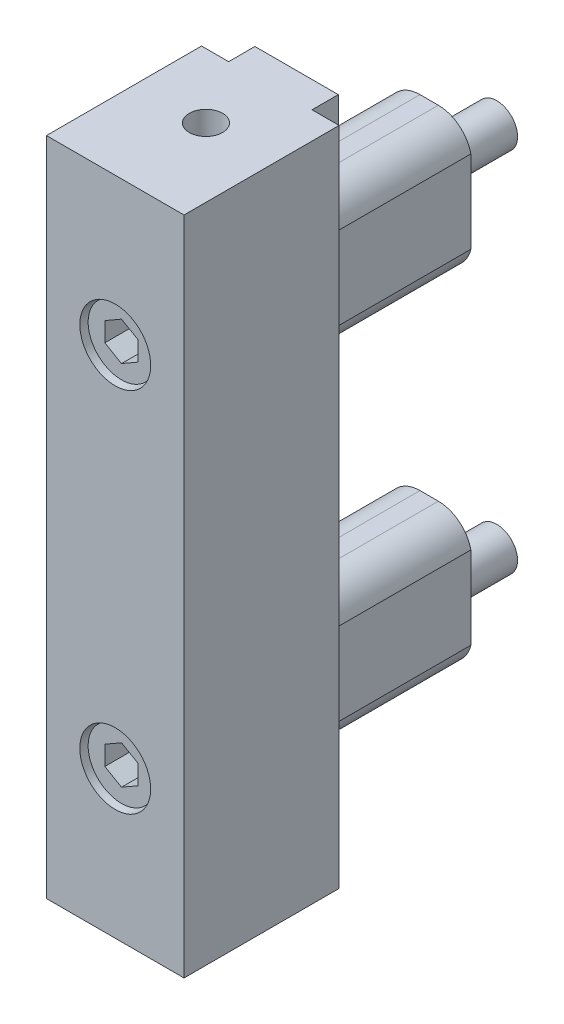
ISO-10303-21;
HEADER;
FILE_DESCRIPTION(('STEP AP214'),'2;1');
FILE_NAME('part.step','',(''),(''),'','','');
FILE_SCHEMA(('AUTOMOTIVE_DESIGN { 1 0 10303 214 1 1 1 1 }'));
ENDSEC;
DATA;
#1=APPLICATION_CONTEXT('core data for automotive mechanical design processes');
#2=APPLICATION_PROTOCOL_DEFINITION('international standard','automotive_design',2000,#1);
#3=PRODUCT_CONTEXT('',#1,'mechanical');
#4=PRODUCT('Part','Part','',(#3));
#5=PRODUCT_RELATED_PRODUCT_CATEGORY('part','',(#4));
#6=PRODUCT_DEFINITION_FORMATION('','',#4);
#7=PRODUCT_DEFINITION_CONTEXT('part definition',#1,'design');
#8=PRODUCT_DEFINITION('design','',#6,#7);
#9=PRODUCT_DEFINITION_SHAPE('','',#8);
#10=(LENGTH_UNIT() NAMED_UNIT(*) SI_UNIT(.MILLI.,.METRE.));
#11=(NAMED_UNIT(*) PLANE_ANGLE_UNIT() SI_UNIT($,.RADIAN.));
#12=(NAMED_UNIT(*) SI_UNIT($,.STERADIAN.) SOLID_ANGLE_UNIT());
#13=UNCERTAINTY_MEASURE_WITH_UNIT(LENGTH_MEASURE(1.E-05),#10,'distance_accuracy_value','');
#14=(GEOMETRIC_REPRESENTATION_CONTEXT(3) GLOBAL_UNCERTAINTY_ASSIGNED_CONTEXT((#13)) GLOBAL_UNIT_ASSIGNED_CONTEXT((#10,
#11,#12)) REPRESENTATION_CONTEXT('',''));
#15=CARTESIAN_POINT('',(0.,0.,0.));
#16=DIRECTION('',(0.,0.,1.));
#17=DIRECTION('',(1.,0.,0.));
#18=AXIS2_PLACEMENT_3D('',#15,#16,#17);
#19=CARTESIAN_POINT('',(4.00000000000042,-50.9282032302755,34.9));
#20=DIRECTION('',(0.,0.,-1.));
#21=DIRECTION('',(0.866025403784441,-0.5,0.));
#22=AXIS2_PLACEMENT_3D('',#19,#20,#21);
#23=PLANE('',#22);
#24=DIRECTION('',(-0.866025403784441,0.5,0.));
#25=VECTOR('',#24,1.);
#26=CARTESIAN_POINT('',(4.00000000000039,-41.6905989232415,34.9));
#27=LINE('',#26,#25);
#28=CARTESIAN_POINT('',(4.00000000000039,-41.6905989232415,34.9));
#29=VERTEX_POINT('',#28);
#30=CARTESIAN_POINT('',(3.79903072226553E-13,-39.381197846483,34.9));
#31=VERTEX_POINT('',#30);
#32=EDGE_CURVE('E354',#29,#31,#27,.T.);
#33=ORIENTED_EDGE('',*,*,#32,.T.);
#34=DIRECTION('',(-0.866025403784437,-0.5,0.));
#35=VECTOR('',#34,1.);
#36=CARTESIAN_POINT('',(3.79469391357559E-13,-39.381197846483,34.9));
#37=LINE('',#36,#35);
#38=CARTESIAN_POINT('',(-3.99999999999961,-41.6905989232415,34.9));
#39=VERTEX_POINT('',#38);
#40=EDGE_CURVE('E1430',#31,#39,#37,.T.);
#41=ORIENTED_EDGE('',*,*,#40,.T.);
#42=DIRECTION('',(0.,1.,0.));
#43=VECTOR('',#42,1.);
#44=CARTESIAN_POINT('',(-3.99999999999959,-46.3094010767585,34.9));
#45=LINE('',#44,#43);
#46=CARTESIAN_POINT('',(-3.99999999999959,-46.3094010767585,34.9));
#47=VERTEX_POINT('',#46);
#48=EDGE_CURVE('E1438',#47,#39,#45,.T.);
#49=ORIENTED_EDGE('',*,*,#48,.F.);
#50=DIRECTION('',(-0.866025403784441,0.5,0.));
#51=VECTOR('',#50,1.);
#52=CARTESIAN_POINT('',(4.13457037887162E-13,-48.618802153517,34.9));
#53=LINE('',#52,#51);
#54=CARTESIAN_POINT('',(4.13457037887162E-13,-48.618802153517,34.9));
#55=VERTEX_POINT('',#54);
#56=EDGE_CURVE('E1541',#55,#47,#53,.T.);
#57=ORIENTED_EDGE('',*,*,#56,.F.);
#58=DIRECTION('',(0.866025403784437,0.5,0.));
#59=VECTOR('',#58,1.);
#60=CARTESIAN_POINT('',(4.13457037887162E-13,-48.618802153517,34.9));
#61=LINE('',#60,#59);
#62=CARTESIAN_POINT('',(4.00000000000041,-46.3094010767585,34.9));
#63=VERTEX_POINT('',#62);
#64=EDGE_CURVE('E1532',#55,#63,#61,.T.);
#65=ORIENTED_EDGE('',*,*,#64,.T.);
#66=DIRECTION('',(0.,-1.,0.));
#67=VECTOR('',#66,1.);
#68=CARTESIAN_POINT('',(4.00000000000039,-41.6905989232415,34.9));
#69=LINE('',#68,#67);
#70=EDGE_CURVE('E1526',#29,#63,#69,.T.);
#71=ORIENTED_EDGE('',*,*,#70,.F.);
#72=EDGE_LOOP('',(#33,#41,#49,#57,#65,#71));
#73=FACE_BOUND('',#72,.T.);
#74=ADVANCED_FACE('F16',(#73),#23,.F.);
#75=CARTESIAN_POINT('',(4.00000000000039,-41.6905989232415,34.9));
#76=DIRECTION('',(-1.,0.,0.));
#77=DIRECTION('',(0.,-1.,0.));
#78=AXIS2_PLACEMENT_3D('',#75,#76,#77);
#79=PLANE('',#78);
#80=ORIENTED_EDGE('',*,*,#70,.T.);
#81=DIRECTION('',(0.,0.,1.));
#82=VECTOR('',#81,1.);
#83=CARTESIAN_POINT('',(4.00000000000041,-46.3094010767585,34.9));
#84=LINE('',#83,#82);
#85=CARTESIAN_POINT('',(4.00000000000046,-46.3094010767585,42.));
#86=VERTEX_POINT('',#85);
#87=EDGE_CURVE('E1524',#63,#86,#84,.T.);
#88=ORIENTED_EDGE('',*,*,#87,.T.);
#89=DIRECTION('',(0.,1.,0.));
#90=VECTOR('',#89,1.);
#91=CARTESIAN_POINT('',(4.00000000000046,-46.3094010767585,42.));
#92=LINE('',#91,#90);
#93=CARTESIAN_POINT('',(4.00000000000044,-41.6905989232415,42.));
#94=VERTEX_POINT('',#93);
#95=EDGE_CURVE('E1448',#86,#94,#92,.T.);
#96=ORIENTED_EDGE('',*,*,#95,.T.);
#97=DIRECTION('',(0.,0.,1.));
#98=VECTOR('',#97,1.);
#99=CARTESIAN_POINT('',(4.00000000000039,-41.6905989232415,34.9));
#100=LINE('',#99,#98);
#101=EDGE_CURVE('E1529',#94,#29,#100,.F.);
#102=ORIENTED_EDGE('',*,*,#101,.T.);
#103=EDGE_LOOP('',(#80,#88,#96,#102));
#104=FACE_BOUND('',#103,.T.);
#105=ADVANCED_FACE('F759',(#104),#79,.T.);
#106=CARTESIAN_POINT('',(4.00000000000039,-41.6905989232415,34.9));
#107=DIRECTION('',(0.5,0.866025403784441,0.));
#108=DIRECTION('',(-0.866025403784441,0.5,0.));
#109=AXIS2_PLACEMENT_3D('',#106,#107,#108);
#110=PLANE('',#109);
#111=DIRECTION('',(0.,0.,1.));
#112=VECTOR('',#111,1.);
#113=CARTESIAN_POINT('',(3.79469391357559E-13,-39.381197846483,34.9));
#114=LINE('',#113,#112);
#115=CARTESIAN_POINT('',(4.28614745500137E-13,-39.381197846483,42.));
#116=VERTEX_POINT('',#115);
#117=EDGE_CURVE('E1422',#116,#31,#114,.F.);
#118=ORIENTED_EDGE('',*,*,#117,.T.);
#119=ORIENTED_EDGE('',*,*,#32,.F.);
#120=ORIENTED_EDGE('',*,*,#101,.F.);
#121=DIRECTION('',(0.866025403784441,-0.5,0.));
#122=VECTOR('',#121,1.);
#123=CARTESIAN_POINT('',(2.00000000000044,-40.5358983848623,42.));
#124=LINE('',#123,#122);
#125=EDGE_CURVE('E1427',#94,#116,#124,.F.);
#126=ORIENTED_EDGE('',*,*,#125,.T.);
#127=EDGE_LOOP('',(#118,#119,#120,#126));
#128=FACE_BOUND('',#127,.T.);
#129=ADVANCED_FACE('F766',(#128),#110,.F.);
#130=CARTESIAN_POINT('',(3.79469391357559E-13,-39.381197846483,34.9));
#131=DIRECTION('',(-0.5,0.866025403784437,0.));
#132=DIRECTION('',(-0.866025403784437,-0.5,0.));
#133=AXIS2_PLACEMENT_3D('',#130,#131,#132);
#134=PLANE('',#133);
#135=DIRECTION('',(0.,0.,1.));
#136=VECTOR('',#135,1.);
#137=CARTESIAN_POINT('',(-3.99999999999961,-41.6905989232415,34.9));
#138=LINE('',#137,#136);
#139=CARTESIAN_POINT('',(-3.99999999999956,-41.6905989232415,42.));
#140=VERTEX_POINT('',#139);
#141=EDGE_CURVE('E1435',#39,#140,#138,.T.);
#142=ORIENTED_EDGE('',*,*,#141,.F.);
#143=ORIENTED_EDGE('',*,*,#40,.F.);
#144=ORIENTED_EDGE('',*,*,#117,.F.);
#145=DIRECTION('',(-0.866025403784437,-0.5,0.));
#146=VECTOR('',#145,1.);
#147=CARTESIAN_POINT('',(4.28614745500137E-13,-39.381197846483,42.));
#148=LINE('',#147,#146);
#149=EDGE_CURVE('E1521',#116,#140,#148,.T.);
#150=ORIENTED_EDGE('',*,*,#149,.T.);
#151=EDGE_LOOP('',(#142,#143,#144,#150));
#152=FACE_BOUND('',#151,.T.);
#153=ADVANCED_FACE('F1277',(#152),#134,.F.);
#154=CARTESIAN_POINT('',(-3.99999999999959,-46.3094010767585,34.9));
#155=DIRECTION('',(1.,0.,0.));
#156=DIRECTION('',(0.,1.,0.));
#157=AXIS2_PLACEMENT_3D('',#154,#155,#156);
#158=PLANE('',#157);
#159=ORIENTED_EDGE('',*,*,#48,.T.);
#160=ORIENTED_EDGE('',*,*,#141,.T.);
#161=DIRECTION('',(0.,-1.,0.));
#162=VECTOR('',#161,1.);
#163=CARTESIAN_POINT('',(-3.99999999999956,-41.6905989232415,42.));
#164=LINE('',#163,#162);
#165=CARTESIAN_POINT('',(-3.99999999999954,-46.3094010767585,42.));
#166=VERTEX_POINT('',#165);
#167=EDGE_CURVE('E1517',#140,#166,#164,.T.);
#168=ORIENTED_EDGE('',*,*,#167,.T.);
#169=DIRECTION('',(0.,0.,1.));
#170=VECTOR('',#169,1.);
#171=CARTESIAN_POINT('',(-3.99999999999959,-46.3094010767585,34.9));
#172=LINE('',#171,#170);
#173=EDGE_CURVE('E1538',#47,#166,#172,.T.);
#174=ORIENTED_EDGE('',*,*,#173,.F.);
#175=EDGE_LOOP('',(#159,#160,#168,#174));
#176=FACE_BOUND('',#175,.T.);
#177=ADVANCED_FACE('F1269',(#176),#158,.T.);
#178=CARTESIAN_POINT('',(4.13457037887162E-13,-48.618802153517,34.9));
#179=DIRECTION('',(0.5,0.866025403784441,0.));
#180=DIRECTION('',(-0.866025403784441,0.5,0.));
#181=AXIS2_PLACEMENT_3D('',#178,#179,#180);
#182=PLANE('',#181);
#183=ORIENTED_EDGE('',*,*,#56,.T.);
#184=ORIENTED_EDGE('',*,*,#173,.T.);
#185=DIRECTION('',(0.866025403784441,-0.5,0.));
#186=VECTOR('',#185,1.);
#187=CARTESIAN_POINT('',(-1.99999999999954,-47.4641016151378,42.));
#188=LINE('',#187,#186);
#189=CARTESIAN_POINT('',(4.6260239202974E-13,-48.618802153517,42.));
#190=VERTEX_POINT('',#189);
#191=EDGE_CURVE('E1513',#166,#190,#188,.T.);
#192=ORIENTED_EDGE('',*,*,#191,.T.);
#193=DIRECTION('',(0.,0.,1.));
#194=VECTOR('',#193,1.);
#195=CARTESIAN_POINT('',(4.13457037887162E-13,-48.618802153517,34.9));
#196=LINE('',#195,#194);
#197=EDGE_CURVE('E1535',#190,#55,#196,.F.);
#198=ORIENTED_EDGE('',*,*,#197,.T.);
#199=EDGE_LOOP('',(#183,#184,#192,#198));
#200=FACE_BOUND('',#199,.T.);
#201=ADVANCED_FACE('F1262',(#200),#182,.T.);
#202=CARTESIAN_POINT('',(4.13457037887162E-13,-48.618802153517,34.9));
#203=DIRECTION('',(0.5,-0.866025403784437,0.));
#204=DIRECTION('',(0.866025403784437,0.5,0.));
#205=AXIS2_PLACEMENT_3D('',#202,#203,#204);
#206=PLANE('',#205);
#207=ORIENTED_EDGE('',*,*,#87,.F.);
#208=ORIENTED_EDGE('',*,*,#64,.F.);
#209=ORIENTED_EDGE('',*,*,#197,.F.);
#210=DIRECTION('',(0.866025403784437,0.5,0.));
#211=VECTOR('',#210,1.);
#212=CARTESIAN_POINT('',(4.6260239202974E-13,-48.618802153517,42.));
#213=LINE('',#212,#211);
#214=EDGE_CURVE('E35',#190,#86,#213,.T.);
#215=ORIENTED_EDGE('',*,*,#214,.T.);
#216=EDGE_LOOP('',(#207,#208,#209,#215));
#217=FACE_BOUND('',#216,.T.);
#218=ADVANCED_FACE('F777',(#217),#206,.F.);
#219=CARTESIAN_POINT('',(-3.79999999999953,-50.5817930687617,42.));
#220=DIRECTION('',(0.,0.,-1.));
#221=DIRECTION('',(0.866025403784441,-0.5,0.));
#222=AXIS2_PLACEMENT_3D('',#219,#220,#221);
#223=PLANE('',#222);
#224=CARTESIAN_POINT('',(4.46485511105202E-13,-44.,42.));
#225=DIRECTION('',(0.,0.,-1.));
#226=DIRECTION('',(0.866025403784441,-0.5,0.));
#227=AXIS2_PLACEMENT_3D('',#224,#225,#226);
#228=CIRCLE('',#227,8.);
#229=CARTESIAN_POINT('',(6.92820323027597,-48.,42.));
#230=VERTEX_POINT('',#229);
#231=EDGE_CURVE('E1447',#230,#230,#228,.T.);
#232=ORIENTED_EDGE('',*,*,#231,.F.);
#233=EDGE_LOOP('',(#232));
#234=FACE_BOUND('',#233,.T.);
#235=ORIENTED_EDGE('',*,*,#214,.F.);
#236=ORIENTED_EDGE('',*,*,#191,.F.);
#237=ORIENTED_EDGE('',*,*,#167,.F.);
#238=ORIENTED_EDGE('',*,*,#149,.F.);
#239=ORIENTED_EDGE('',*,*,#125,.F.);
#240=ORIENTED_EDGE('',*,*,#95,.F.);
#241=EDGE_LOOP('',(#235,#236,#237,#238,#239,#240));
#242=FACE_BOUND('',#241,.T.);
#243=ADVANCED_FACE('F773',(#234,#242),#223,.F.);
#244=CARTESIAN_POINT('',(3.77079984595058E-13,-44.,32.));
#245=DIRECTION('',(0.,0.,1.));
#246=DIRECTION('',(-0.866025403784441,0.5,0.));
#247=AXIS2_PLACEMENT_3D('',#244,#245,#246);
#248=CYLINDRICAL_SURFACE('',#247,8.);
#249=CARTESIAN_POINT('',(3.77079984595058E-13,-44.,32.));
#250=DIRECTION('',(0.,0.,1.));
#251=DIRECTION('',(-0.866025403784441,0.5,0.));
#252=AXIS2_PLACEMENT_3D('',#249,#250,#251);
#253=CIRCLE('',#252,8.);
#254=CARTESIAN_POINT('',(-6.92820323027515,-40.,32.));
#255=VERTEX_POINT('',#254);
#256=EDGE_CURVE('E1444',#255,#255,#253,.T.);
#257=ORIENTED_EDGE('',*,*,#256,.T.);
#258=EDGE_LOOP('',(#257));
#259=FACE_BOUND('',#258,.T.);
#260=ORIENTED_EDGE('',*,*,#231,.T.);
#261=EDGE_LOOP('',(#260));
#262=FACE_BOUND('',#261,.T.);
#263=ADVANCED_FACE('F776',(#259,#262),#248,.T.);
#264=CARTESIAN_POINT('',(4.00000000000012,37.0717967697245,34.9));
#265=DIRECTION('',(0.,0.,-1.));
#266=DIRECTION('',(0.866025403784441,-0.5,0.));
#267=AXIS2_PLACEMENT_3D('',#264,#265,#266);
#268=PLANE('',#267);
#269=DIRECTION('',(-0.866025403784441,0.5,0.));
#270=VECTOR('',#269,1.);
#271=CARTESIAN_POINT('',(4.00000000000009,46.3094010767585,34.9));
#272=LINE('',#271,#270);
#273=CARTESIAN_POINT('',(4.00000000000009,46.3094010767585,34.9));
#274=VERTEX_POINT('',#273);
#275=CARTESIAN_POINT('',(0.,48.618802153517,34.9));
#276=VERTEX_POINT('',#275);
#277=EDGE_CURVE('E329',#274,#276,#272,.T.);
#278=ORIENTED_EDGE('',*,*,#277,.T.);
#279=DIRECTION('',(-0.866025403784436,-0.5,0.));
#280=VECTOR('',#279,1.);
#281=CARTESIAN_POINT('',(0.,48.618802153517,34.9));
#282=LINE('',#281,#280);
#283=CARTESIAN_POINT('',(-3.99999999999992,46.3094010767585,34.9));
#284=VERTEX_POINT('',#283);
#285=EDGE_CURVE('E337',#276,#284,#282,.T.);
#286=ORIENTED_EDGE('',*,*,#285,.T.);
#287=DIRECTION('',(0.,1.,0.));
#288=VECTOR('',#287,1.);
#289=CARTESIAN_POINT('',(-3.9999999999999,41.6905989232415,34.9));
#290=LINE('',#289,#288);
#291=CARTESIAN_POINT('',(-3.9999999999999,41.6905989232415,34.9));
#292=VERTEX_POINT('',#291);
#293=EDGE_CURVE('E1488',#292,#284,#290,.T.);
#294=ORIENTED_EDGE('',*,*,#293,.F.);
#295=DIRECTION('',(-0.866025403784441,0.5,0.));
#296=VECTOR('',#295,1.);
#297=CARTESIAN_POINT('',(1.00135147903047E-13,39.381197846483,34.9));
#298=LINE('',#297,#296);
#299=CARTESIAN_POINT('',(1.00135147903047E-13,39.381197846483,34.9));
#300=VERTEX_POINT('',#299);
#301=EDGE_CURVE('E1482',#300,#292,#298,.T.);
#302=ORIENTED_EDGE('',*,*,#301,.F.);
#303=DIRECTION('',(0.866025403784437,0.5,0.));
#304=VECTOR('',#303,1.);
#305=CARTESIAN_POINT('',(1.00135147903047E-13,39.381197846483,34.9));
#306=LINE('',#305,#304);
#307=CARTESIAN_POINT('',(4.0000000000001,41.6905989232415,34.9));
#308=VERTEX_POINT('',#307);
#309=EDGE_CURVE('E1474',#300,#308,#306,.T.);
#310=ORIENTED_EDGE('',*,*,#309,.T.);
#311=DIRECTION('',(0.,-1.,0.));
#312=VECTOR('',#311,1.);
#313=CARTESIAN_POINT('',(4.00000000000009,46.3094010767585,34.9));
#314=LINE('',#313,#312);
#315=EDGE_CURVE('E1468',#274,#308,#314,.T.);
#316=ORIENTED_EDGE('',*,*,#315,.F.);
#317=EDGE_LOOP('',(#278,#286,#294,#302,#310,#316));
#318=FACE_BOUND('',#317,.T.);
#319=ADVANCED_FACE('F781',(#318),#268,.F.);
#320=CARTESIAN_POINT('',(4.00000000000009,46.3094010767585,34.9));
#321=DIRECTION('',(-1.,0.,0.));
#322=DIRECTION('',(0.,-1.,0.));
#323=AXIS2_PLACEMENT_3D('',#320,#321,#322);
#324=PLANE('',#323);
#325=ORIENTED_EDGE('',*,*,#315,.T.);
#326=DIRECTION('',(0.,0.,1.));
#327=VECTOR('',#326,1.);
#328=CARTESIAN_POINT('',(4.0000000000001,41.6905989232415,34.9));
#329=LINE('',#328,#327);
#330=CARTESIAN_POINT('',(4.00000000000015,41.6905989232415,42.));
#331=VERTEX_POINT('',#330);
#332=EDGE_CURVE('E1465',#308,#331,#329,.T.);
#333=ORIENTED_EDGE('',*,*,#332,.T.);
#334=DIRECTION('',(0.,1.,0.));
#335=VECTOR('',#334,1.);
#336=CARTESIAN_POINT('',(4.00000000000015,41.6905989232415,42.));
#337=LINE('',#336,#335);
#338=CARTESIAN_POINT('',(4.00000000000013,46.3094010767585,42.));
#339=VERTEX_POINT('',#338);
#340=EDGE_CURVE('E345',#331,#339,#337,.T.);
#341=ORIENTED_EDGE('',*,*,#340,.T.);
#342=DIRECTION('',(0.,0.,1.));
#343=VECTOR('',#342,1.);
#344=CARTESIAN_POINT('',(4.00000000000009,46.3094010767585,34.9));
#345=LINE('',#344,#343);
#346=EDGE_CURVE('E1471',#339,#274,#345,.F.);
#347=ORIENTED_EDGE('',*,*,#346,.T.);
#348=EDGE_LOOP('',(#325,#333,#341,#347));
#349=FACE_BOUND('',#348,.T.);
#350=ADVANCED_FACE('F790',(#349),#324,.T.);
#351=CARTESIAN_POINT('',(4.00000000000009,46.3094010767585,34.9));
#352=DIRECTION('',(0.5,0.866025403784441,0.));
#353=DIRECTION('',(-0.866025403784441,0.5,0.));
#354=AXIS2_PLACEMENT_3D('',#351,#352,#353);
#355=PLANE('',#354);
#356=DIRECTION('',(0.,0.,1.));
#357=VECTOR('',#356,1.);
#358=CARTESIAN_POINT('',(0.,48.618802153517,34.9));
#359=LINE('',#358,#357);
#360=CARTESIAN_POINT('',(1.13558132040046E-13,48.618802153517,42.));
#361=VERTEX_POINT('',#360);
#362=EDGE_CURVE('E332',#361,#276,#359,.F.);
#363=ORIENTED_EDGE('',*,*,#362,.T.);
#364=ORIENTED_EDGE('',*,*,#277,.F.);
#365=ORIENTED_EDGE('',*,*,#346,.F.);
#366=DIRECTION('',(0.866025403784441,-0.5,0.));
#367=VECTOR('',#366,1.);
#368=CARTESIAN_POINT('',(2.00000000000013,47.4641016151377,42.));
#369=LINE('',#368,#367);
#370=EDGE_CURVE('E1463',#339,#361,#369,.F.);
#371=ORIENTED_EDGE('',*,*,#370,.T.);
#372=EDGE_LOOP('',(#363,#364,#365,#371));
#373=FACE_BOUND('',#372,.T.);
#374=ADVANCED_FACE('F793',(#373),#355,.F.);
#375=CARTESIAN_POINT('',(0.,48.618802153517,34.9));
#376=DIRECTION('',(-0.5,0.866025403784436,0.));
#377=DIRECTION('',(-0.866025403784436,-0.5,0.));
#378=AXIS2_PLACEMENT_3D('',#375,#376,#377);
#379=PLANE('',#378);
#380=DIRECTION('',(0.,0.,1.));
#381=VECTOR('',#380,1.);
#382=CARTESIAN_POINT('',(-3.99999999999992,46.3094010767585,34.9));
#383=LINE('',#382,#381);
#384=CARTESIAN_POINT('',(-3.99999999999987,46.3094010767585,42.));
#385=VERTEX_POINT('',#384);
#386=EDGE_CURVE('E1485',#284,#385,#383,.T.);
#387=ORIENTED_EDGE('',*,*,#386,.F.);
#388=ORIENTED_EDGE('',*,*,#285,.F.);
#389=ORIENTED_EDGE('',*,*,#362,.F.);
#390=DIRECTION('',(-0.866025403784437,-0.5,0.));
#391=VECTOR('',#390,1.);
#392=CARTESIAN_POINT('',(1.13558132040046E-13,48.618802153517,42.));
#393=LINE('',#392,#391);
#394=EDGE_CURVE('E1461',#361,#385,#393,.T.);
#395=ORIENTED_EDGE('',*,*,#394,.T.);
#396=EDGE_LOOP('',(#387,#388,#389,#395));
#397=FACE_BOUND('',#396,.T.);
#398=ADVANCED_FACE('F807',(#397),#379,.F.);
#399=CARTESIAN_POINT('',(-3.9999999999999,41.6905989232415,34.9));
#400=DIRECTION('',(1.,0.,0.));
#401=DIRECTION('',(0.,1.,0.));
#402=AXIS2_PLACEMENT_3D('',#399,#400,#401);
#403=PLANE('',#402);
#404=ORIENTED_EDGE('',*,*,#293,.T.);
#405=ORIENTED_EDGE('',*,*,#386,.T.);
#406=DIRECTION('',(0.,-1.,0.));
#407=VECTOR('',#406,1.);
#408=CARTESIAN_POINT('',(-3.99999999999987,46.3094010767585,42.));
#409=LINE('',#408,#407);
#410=CARTESIAN_POINT('',(-3.99999999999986,41.6905989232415,42.));
#411=VERTEX_POINT('',#410);
#412=EDGE_CURVE('E1459',#385,#411,#409,.T.);
#413=ORIENTED_EDGE('',*,*,#412,.T.);
#414=DIRECTION('',(0.,0.,1.));
#415=VECTOR('',#414,1.);
#416=CARTESIAN_POINT('',(-3.9999999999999,41.6905989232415,34.9));
#417=LINE('',#416,#415);
#418=EDGE_CURVE('E1479',#292,#411,#417,.T.);
#419=ORIENTED_EDGE('',*,*,#418,.F.);
#420=EDGE_LOOP('',(#404,#405,#413,#419));
#421=FACE_BOUND('',#420,.T.);
#422=ADVANCED_FACE('F803',(#421),#403,.T.);
#423=CARTESIAN_POINT('',(1.00135147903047E-13,39.381197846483,34.9));
#424=DIRECTION('',(0.5,0.866025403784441,0.));
#425=DIRECTION('',(-0.866025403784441,0.5,0.));
#426=AXIS2_PLACEMENT_3D('',#423,#424,#425);
#427=PLANE('',#426);
#428=ORIENTED_EDGE('',*,*,#301,.T.);
#429=ORIENTED_EDGE('',*,*,#418,.T.);
#430=DIRECTION('',(0.866025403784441,-0.5,0.));
#431=VECTOR('',#430,1.);
#432=CARTESIAN_POINT('',(-1.99999999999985,40.5358983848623,42.));
#433=LINE('',#432,#431);
#434=CARTESIAN_POINT('',(1.4971418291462E-13,39.381197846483,42.));
#435=VERTEX_POINT('',#434);
#436=EDGE_CURVE('E1457',#411,#435,#433,.T.);
#437=ORIENTED_EDGE('',*,*,#436,.T.);
#438=DIRECTION('',(0.,0.,1.));
#439=VECTOR('',#438,1.);
#440=CARTESIAN_POINT('',(1.00135147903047E-13,39.381197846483,34.9));
#441=LINE('',#440,#439);
#442=EDGE_CURVE('E1476',#435,#300,#441,.F.);
#443=ORIENTED_EDGE('',*,*,#442,.T.);
#444=EDGE_LOOP('',(#428,#429,#437,#443));
#445=FACE_BOUND('',#444,.T.);
#446=ADVANCED_FACE('F799',(#445),#427,.T.);
#447=CARTESIAN_POINT('',(1.00135147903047E-13,39.381197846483,34.9));
#448=DIRECTION('',(0.5,-0.866025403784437,0.));
#449=DIRECTION('',(0.866025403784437,0.5,0.));
#450=AXIS2_PLACEMENT_3D('',#447,#448,#449);
#451=PLANE('',#450);
#452=ORIENTED_EDGE('',*,*,#332,.F.);
#453=ORIENTED_EDGE('',*,*,#309,.F.);
#454=ORIENTED_EDGE('',*,*,#442,.F.);
#455=DIRECTION('',(0.866025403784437,0.5,0.));
#456=VECTOR('',#455,1.);
#457=CARTESIAN_POINT('',(1.4971418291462E-13,39.381197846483,42.));
#458=LINE('',#457,#456);
#459=EDGE_CURVE('E1455',#435,#331,#458,.T.);
#460=ORIENTED_EDGE('',*,*,#459,.T.);
#461=EDGE_LOOP('',(#452,#453,#454,#460));
#462=FACE_BOUND('',#461,.T.);
#463=ADVANCED_FACE('F795',(#462),#451,.F.);
#464=CARTESIAN_POINT('',(-3.79999999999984,37.4182069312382,42.));
#465=DIRECTION('',(0.,0.,-1.));
#466=DIRECTION('',(0.866025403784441,-0.5,0.));
#467=AXIS2_PLACEMENT_3D('',#464,#465,#466);
#468=PLANE('',#467);
#469=CARTESIAN_POINT('',(1.32720359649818E-13,44.,42.));
#470=DIRECTION('',(0.,0.,-1.));
#471=DIRECTION('',(0.866025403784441,-0.5,0.));
#472=AXIS2_PLACEMENT_3D('',#469,#470,#471);
#473=CIRCLE('',#472,8.);
#474=CARTESIAN_POINT('',(6.92820323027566,40.,42.));
#475=VERTEX_POINT('',#474);
#476=EDGE_CURVE('E344',#475,#475,#473,.T.);
#477=ORIENTED_EDGE('',*,*,#476,.F.);
#478=EDGE_LOOP('',(#477));
#479=FACE_BOUND('',#478,.T.);
#480=ORIENTED_EDGE('',*,*,#459,.F.);
#481=ORIENTED_EDGE('',*,*,#436,.F.);
#482=ORIENTED_EDGE('',*,*,#412,.F.);
#483=ORIENTED_EDGE('',*,*,#394,.F.);
#484=ORIENTED_EDGE('',*,*,#370,.F.);
#485=ORIENTED_EDGE('',*,*,#340,.F.);
#486=EDGE_LOOP('',(#480,#481,#482,#483,#484,#485));
#487=FACE_BOUND('',#486,.T.);
#488=ADVANCED_FACE('F798',(#479,#487),#468,.F.);
#489=CARTESIAN_POINT('',(0.,44.,32.));
#490=DIRECTION('',(0.,0.,1.));
#491=DIRECTION('',(-0.866025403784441,0.5,0.));
#492=AXIS2_PLACEMENT_3D('',#489,#490,#491);
#493=CYLINDRICAL_SURFACE('',#492,8.);
#494=CARTESIAN_POINT('',(0.,44.,32.));
#495=DIRECTION('',(0.,0.,1.));
#496=DIRECTION('',(-0.866025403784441,0.5,0.));
#497=AXIS2_PLACEMENT_3D('',#494,#495,#496);
#498=CIRCLE('',#497,8.);
#499=CARTESIAN_POINT('',(-6.92820323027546,48.,32.));
#500=VERTEX_POINT('',#499);
#501=EDGE_CURVE('E341',#500,#500,#498,.T.);
#502=ORIENTED_EDGE('',*,*,#501,.T.);
#503=EDGE_LOOP('',(#502));
#504=FACE_BOUND('',#503,.T.);
#505=ORIENTED_EDGE('',*,*,#476,.T.);
#506=EDGE_LOOP('',(#505));
#507=FACE_BOUND('',#506,.T.);
#508=ADVANCED_FACE('F819',(#504,#507),#493,.T.);
#509=CARTESIAN_POINT('',(3.72715632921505E-13,-63.25,21.75));
#510=DIRECTION('',(0.,-1.,0.));
#511=DIRECTION('',(1.,0.,0.));
#512=AXIS2_PLACEMENT_3D('',#509,#510,#511);
#513=PLANE('',#512);
#514=CARTESIAN_POINT('',(3.72715632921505E-13,-63.25,21.75));
#515=DIRECTION('',(0.,-1.,0.));
#516=DIRECTION('',(1.,0.,0.));
#517=AXIS2_PLACEMENT_3D('',#514,#515,#516);
#518=CIRCLE('',#517,4.);
#519=CARTESIAN_POINT('',(4.00000000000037,-63.25,21.75));
#520=VERTEX_POINT('',#519);
#521=EDGE_CURVE('E355',#520,#520,#518,.T.);
#522=ORIENTED_EDGE('',*,*,#521,.T.);
#523=EDGE_LOOP('',(#522));
#524=FACE_BOUND('',#523,.T.);
#525=ADVANCED_FACE('F823',(#524),#513,.T.);
#526=CARTESIAN_POINT('',(0.,63.25,21.75));
#527=DIRECTION('',(0.,1.,0.));
#528=DIRECTION('',(-1.,0.,0.));
#529=AXIS2_PLACEMENT_3D('',#526,#527,#528);
#530=PLANE('',#529);
#531=CARTESIAN_POINT('',(0.,63.25,21.75));
#532=DIRECTION('',(0.,1.,0.));
#533=DIRECTION('',(-1.,0.,0.));
#534=AXIS2_PLACEMENT_3D('',#531,#532,#533);
#535=CIRCLE('',#534,4.);
#536=CARTESIAN_POINT('',(-4.00000000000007,63.25,21.75));
#537=VERTEX_POINT('',#536);
#538=EDGE_CURVE('E362',#537,#537,#535,.T.);
#539=ORIENTED_EDGE('',*,*,#538,.T.);
#540=EDGE_LOOP('',(#539));
#541=FACE_BOUND('',#540,.T.);
#542=ADVANCED_FACE('F827',(#541),#530,.T.);
#543=CARTESIAN_POINT('',(-5.00644868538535E-13,44.,-48.));
#544=DIRECTION('',(0.,0.,1.));
#545=DIRECTION('',(-0.866025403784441,0.5,0.));
#546=AXIS2_PLACEMENT_3D('',#543,#544,#545);
#547=PLANE('',#546);
#548=CARTESIAN_POINT('',(-4.95746281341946E-13,44.,-48.));
#549=DIRECTION('',(0.,0.,1.));
#550=DIRECTION('',(-0.866025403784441,0.5,0.));
#551=AXIS2_PLACEMENT_3D('',#548,#549,#550);
#552=CIRCLE('',#551,5.);
#553=CARTESIAN_POINT('',(-4.3301270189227,46.5,-48.));
#554=VERTEX_POINT('',#553);
#555=EDGE_CURVE('E348',#554,#554,#552,.T.);
#556=ORIENTED_EDGE('',*,*,#555,.F.);
#557=EDGE_LOOP('',(#556));
#558=FACE_BOUND('',#557,.T.);
#559=ADVANCED_FACE('F556',(#558),#547,.F.);
#560=CARTESIAN_POINT('',(0.,35.5,32.));
#561=DIRECTION('',(0.,0.,-1.));
#562=DIRECTION('',(1.,0.,0.));
#563=AXIS2_PLACEMENT_3D('',#560,#561,#562);
#564=PLANE('',#563);
#565=ORIENTED_EDGE('',*,*,#501,.F.);
#566=EDGE_LOOP('',(#565));
#567=FACE_BOUND('',#566,.T.);
#568=CARTESIAN_POINT('',(0.,44.,32.));
#569=DIRECTION('',(0.,0.,1.));
#570=DIRECTION('',(-1.,0.,0.));
#571=AXIS2_PLACEMENT_3D('',#568,#569,#570);
#572=CIRCLE('',#571,8.5);
#573=CARTESIAN_POINT('',(-8.49999999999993,44.,32.0000000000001));
#574=VERTEX_POINT('',#573);
#575=EDGE_CURVE('E431',#574,#574,#572,.T.);
#576=ORIENTED_EDGE('',*,*,#575,.T.);
#577=EDGE_LOOP('',(#576));
#578=FACE_BOUND('',#577,.T.);
#579=ADVANCED_FACE('F552',(#567,#578),#564,.F.);
#580=CARTESIAN_POINT('',(-13.6828427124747,36.,-1.0999999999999));
#581=DIRECTION('',(1.,0.,0.));
#582=DIRECTION('',(0.,1.,0.));
#583=AXIS2_PLACEMENT_3D('',#580,#581,#582);
#584=CONICAL_SURFACE('',#583,8.86715728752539,0.785398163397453);
#585=DIRECTION('',(0.707106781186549,0.,0.707106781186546));
#586=VECTOR('',#585,1.);
#587=CARTESIAN_POINT('',(-13.6828427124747,36.,7.76715728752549));
#588=LINE('',#587,#586);
#589=CARTESIAN_POINT('',(-15.15,36.,6.30000000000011));
#590=VERTEX_POINT('',#589);
#591=CARTESIAN_POINT('',(-13.4,36.,8.05000000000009));
#592=VERTEX_POINT('',#591);
#593=EDGE_CURVE('E440',#590,#592,#588,.T.);
#594=ORIENTED_EDGE('',*,*,#593,.F.);
#595=CARTESIAN_POINT('',(21.3961429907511,79.3186274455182,6.29999999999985));
#596=CARTESIAN_POINT('',(20.342910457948,78.2501016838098,6.29999999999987));
#597=CARTESIAN_POINT('',(19.2902033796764,77.1810571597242,6.29999999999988));
#598=CARTESIAN_POINT('',(17.1851073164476,75.040456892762,6.2999999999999));
#599=CARTESIAN_POINT('',(16.1327198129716,73.968899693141,6.29999999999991));
#600=CARTESIAN_POINT('',(14.0120611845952,71.8060084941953,6.29999999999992));
#601=CARTESIAN_POINT('',(12.9438203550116,70.7146447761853,6.29999999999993));
#602=CARTESIAN_POINT('',(11.3438437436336,69.0763713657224,6.29999999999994));
#603=CARTESIAN_POINT('',(10.8111901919,68.5303579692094,6.29999999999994));
#604=CARTESIAN_POINT('',(9.74660826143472,67.4376535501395,6.29999999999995));
#605=CARTESIAN_POINT('',(9.21467986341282,66.8909625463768,6.29999999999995));
#606=CARTESIAN_POINT('',(7.69044771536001,65.3220651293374,6.29999999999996));
#607=CARTESIAN_POINT('',(6.69916934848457,64.2988619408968,6.29999999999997));
#608=CARTESIAN_POINT('',(4.7203808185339,62.2485445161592,6.29999999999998));
#609=CARTESIAN_POINT('',(3.73287118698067,61.2214297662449,6.29999999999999));
#610=CARTESIAN_POINT('',(2.25370402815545,59.6745937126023,6.3));
#611=CARTESIAN_POINT('',(1.75996526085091,59.1568627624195,6.30000000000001));
#612=CARTESIAN_POINT('',(0.77420064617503,58.1197731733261,6.30000000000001));
#613=CARTESIAN_POINT('',(0.282174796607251,57.6004145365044,6.30000000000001));
#614=CARTESIAN_POINT('',(-0.699519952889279,56.5599892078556,6.30000000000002));
#615=CARTESIAN_POINT('',(-1.18918995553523,56.0389235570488,6.30000000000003));
#616=CARTESIAN_POINT('',(-2.16591115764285,54.9943517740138,6.30000000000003));
#617=CARTESIAN_POINT('',(-2.6529623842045,54.4708456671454,6.30000000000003));
#618=CARTESIAN_POINT('',(-3.61577624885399,53.4293892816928,6.30000000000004));
#619=CARTESIAN_POINT('',(-4.09159290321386,52.9114889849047,6.30000000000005));
#620=CARTESIAN_POINT('',(-5.03911227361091,51.871893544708,6.30000000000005));
#621=CARTESIAN_POINT('',(-5.5108148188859,51.3501982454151,6.30000000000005));
#622=CARTESIAN_POINT('',(-6.44973266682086,50.3008272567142,6.30000000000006));
#623=CARTESIAN_POINT('',(-6.91693662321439,49.7731414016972,6.30000000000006));
#624=CARTESIAN_POINT('',(-7.84385830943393,48.7113326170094,6.30000000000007));
#625=CARTESIAN_POINT('',(-8.30357705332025,48.177210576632,6.30000000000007));
#626=CARTESIAN_POINT('',(-8.98333917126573,47.3716587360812,6.30000000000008));
#627=CARTESIAN_POINT('',(-9.20734798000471,47.1035754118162,6.30000000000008));
#628=CARTESIAN_POINT('',(-9.65223340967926,46.564824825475,6.30000000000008));
#629=CARTESIAN_POINT('',(-9.87311007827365,46.2941576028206,6.30000000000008));
#630=CARTESIAN_POINT('',(-10.3111970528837,45.7495883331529,6.30000000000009));
#631=CARTESIAN_POINT('',(-10.5284049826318,45.4756843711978,6.30000000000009));
#632=CARTESIAN_POINT('',(-10.9581187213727,44.9242140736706,6.30000000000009));
#633=CARTESIAN_POINT('',(-11.1706246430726,44.6466478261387,6.30000000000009));
#634=CARTESIAN_POINT('',(-11.5890077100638,44.0881072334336,6.3000000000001));
#635=CARTESIAN_POINT('',(-11.7949059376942,43.8071487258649,6.3000000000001));
#636=CARTESIAN_POINT('',(-12.1993237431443,43.2398955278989,6.3000000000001));
#637=CARTESIAN_POINT('',(-12.3978424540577,42.9536002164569,6.3000000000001));
#638=CARTESIAN_POINT('',(-12.7850977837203,42.3749131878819,6.30000000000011));
#639=CARTESIAN_POINT('',(-12.9738452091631,42.082528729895,6.30000000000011));
#640=CARTESIAN_POINT('',(-13.3387940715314,41.4900648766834,6.3000000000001));
#641=CARTESIAN_POINT('',(-13.5149997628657,41.1899881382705,6.30000000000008));
#642=CARTESIAN_POINT('',(-13.7197233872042,40.8183901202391,6.3000000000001));
#643=CARTESIAN_POINT('',(-13.7562002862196,40.7512261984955,6.30000000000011));
#644=CARTESIAN_POINT('',(-13.828294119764,40.6164275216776,6.30000000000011));
#645=CARTESIAN_POINT('',(-13.8639109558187,40.5487927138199,6.30000000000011));
#646=CARTESIAN_POINT('',(-13.9342310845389,40.4130312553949,6.30000000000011));
#647=CARTESIAN_POINT('',(-13.9689341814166,40.3449045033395,6.30000000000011));
#648=CARTESIAN_POINT('',(-14.0373556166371,40.2081609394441,6.30000000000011));
#649=CARTESIAN_POINT('',(-14.0710739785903,40.1395441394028,6.30000000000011));
#650=CARTESIAN_POINT('',(-14.1706611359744,39.9329239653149,6.30000000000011));
#651=CARTESIAN_POINT('',(-14.2349587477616,39.7941570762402,6.30000000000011));
#652=CARTESIAN_POINT('',(-14.3587806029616,39.5145117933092,6.30000000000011));
#653=CARTESIAN_POINT('',(-14.4183049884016,39.373633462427,6.30000000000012));
#654=CARTESIAN_POINT('',(-14.5306429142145,39.0929338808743,6.30000000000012));
#655=CARTESIAN_POINT('',(-14.5835786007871,38.9531618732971,6.30000000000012));
#656=CARTESIAN_POINT('',(-14.6836231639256,38.6715603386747,6.30000000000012));
#657=CARTESIAN_POINT('',(-14.7307318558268,38.529730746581,6.30000000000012));
#658=CARTESIAN_POINT('',(-14.8622264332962,38.1013158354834,6.30000000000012));
#659=CARTESIAN_POINT('',(-14.9368738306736,37.8115775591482,6.3000000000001));
#660=CARTESIAN_POINT('',(-15.0207335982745,37.3945340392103,6.30000000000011));
#661=CARTESIAN_POINT('',(-15.042877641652,37.2697345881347,6.30000000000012));
#662=CARTESIAN_POINT('',(-15.0811609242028,37.0192435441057,6.30000000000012));
#663=CARTESIAN_POINT('',(-15.0973021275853,36.8935522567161,6.30000000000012));
#664=CARTESIAN_POINT('',(-15.123447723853,36.6400991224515,6.30000000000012));
#665=CARTESIAN_POINT('',(-15.1333808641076,36.5123299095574,6.30000000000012));
#666=CARTESIAN_POINT('',(-15.1466694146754,36.2563766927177,6.30000000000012));
#667=CARTESIAN_POINT('',(-15.1500210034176,36.1281924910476,6.30000000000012));
#668=CARTESIAN_POINT('',(-15.15,36.,6.30000000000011));
#669=B_SPLINE_CURVE_WITH_KNOTS('',3,(#595,#596,#597,#598,#599,#600,#601,#602,#603,#604,#605,
#606,#607,#608,#609,#610,#611,#612,#613,#614,#615,#616,#617,#618,#619,#620,#621,#622,#623,#624,
#625,#626,#627,#628,#629,#630,#631,#632,#633,#634,#635,#636,#637,#638,#639,#640,#641,#642,#643,
#644,#645,#646,#647,#648,#649,#650,#651,#652,#653,#654,#655,#656,#657,#658,#659,#660,#661,#662,
#663,#664,#665,#666,#667,#668),.UNSPECIFIED.,.F.,.F.,(4,2,2,2,2,2,2,2,2,2,2,2,2,2,2,2,2,2,2,2,2,
2,2,2,2,2,2,2,2,2,2,2,2,2,2,2,4),(0.,4.50104660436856,9.00679589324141,13.5882682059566,
15.8766412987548,18.1649522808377,22.4388427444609,26.7133152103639,28.8595670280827,
31.0058160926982,33.1509372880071,35.296036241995,37.4059011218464,39.5158531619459,
41.6301847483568,43.7442274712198,44.7922728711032,45.8403023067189,46.8889863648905,
47.9376452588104,48.9825345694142,50.027546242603,51.0713763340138,52.1148506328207,
52.344136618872,52.5734487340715,52.8028095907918,53.0321649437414,53.4908968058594,
53.9496150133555,54.3978650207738,54.8461292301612,55.7419244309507,56.1220606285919,
56.5020723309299,56.8863691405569,57.2708890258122),.UNSPECIFIED.);
#670=CARTESIAN_POINT('',(-13.400000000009,41.3816818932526,6.30000000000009));
#671=VERTEX_POINT('',#670);
#672=EDGE_CURVE('E405',#671,#590,#669,.T.);
#673=ORIENTED_EDGE('',*,*,#672,.F.);
#674=CARTESIAN_POINT('',(-13.4000000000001,36.,-1.09999999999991));
#675=DIRECTION('',(1.,0.,0.));
#676=DIRECTION('',(0.,1.,0.));
#677=AXIS2_PLACEMENT_3D('',#674,#675,#676);
#678=CIRCLE('',#677,9.15);
#679=EDGE_CURVE('E687',#671,#592,#678,.T.);
#680=ORIENTED_EDGE('',*,*,#679,.T.);
#681=EDGE_LOOP('',(#594,#673,#680));
#682=FACE_BOUND('',#681,.T.);
#683=ADVANCED_FACE('F555',(#682),#584,.F.);
#684=CARTESIAN_POINT('',(-13.1171572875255,36.,-1.09999999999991));
#685=DIRECTION('',(-1.,0.,0.));
#686=DIRECTION('',(0.,0.,-1.));
#687=AXIS2_PLACEMENT_3D('',#684,#685,#686);
#688=CONICAL_SURFACE('',#687,8.86715728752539,0.785398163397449);
#689=DIRECTION('',(0.707106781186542,0.,-0.707106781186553));
#690=VECTOR('',#689,1.);
#691=CARTESIAN_POINT('',(-13.1171572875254,36.,7.76715728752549));
#692=LINE('',#691,#690);
#693=CARTESIAN_POINT('',(-11.65,36.,6.30000000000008));
#694=VERTEX_POINT('',#693);
#695=EDGE_CURVE('E444',#592,#694,#692,.T.);
#696=ORIENTED_EDGE('',*,*,#695,.F.);
#697=ORIENTED_EDGE('',*,*,#679,.F.);
#698=CARTESIAN_POINT('',(-11.65,36.,6.30000000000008));
#699=CARTESIAN_POINT('',(-11.6499868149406,36.1136307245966,6.30000000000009));
#700=CARTESIAN_POINT('',(-11.6526169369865,36.2272569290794,6.30000000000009));
#701=CARTESIAN_POINT('',(-11.6630658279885,36.4542530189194,6.3000000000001));
#702=CARTESIAN_POINT('',(-11.6708837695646,36.5676229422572,6.3000000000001));
#703=CARTESIAN_POINT('',(-11.6915906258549,36.7936798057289,6.3000000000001));
#704=CARTESIAN_POINT('',(-11.7044698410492,36.9063676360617,6.3000000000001));
#705=CARTESIAN_POINT('',(-11.735113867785,37.1310722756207,6.3000000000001));
#706=CARTESIAN_POINT('',(-11.7528788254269,37.2430890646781,6.3000000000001));
#707=CARTESIAN_POINT('',(-11.8125784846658,37.5745864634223,6.3000000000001));
#708=CARTESIAN_POINT('',(-11.8612401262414,37.7928819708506,6.3000000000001));
#709=CARTESIAN_POINT('',(-11.9745310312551,38.2253112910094,6.3000000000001));
#710=CARTESIAN_POINT('',(-12.0391675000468,38.439443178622,6.30000000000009));
#711=CARTESIAN_POINT('',(-12.1758458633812,38.8446786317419,6.30000000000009));
#712=CARTESIAN_POINT('',(-12.2467575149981,39.0361673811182,6.3000000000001));
#713=CARTESIAN_POINT('',(-12.3982279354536,39.415232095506,6.3000000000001));
#714=CARTESIAN_POINT('',(-12.4787853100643,39.6028086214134,6.3000000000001));
#715=CARTESIAN_POINT('',(-12.6483572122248,39.9749132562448,6.3000000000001));
#716=CARTESIAN_POINT('',(-12.7374018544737,40.15942755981,6.30000000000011));
#717=CARTESIAN_POINT('',(-12.9223836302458,40.5249398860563,6.3000000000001));
#718=CARTESIAN_POINT('',(-13.0183204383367,40.7059380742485,6.30000000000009));
#719=CARTESIAN_POINT('',(-13.222278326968,41.0761340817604,6.30000000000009));
#720=CARTESIAN_POINT('',(-13.3306799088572,41.2651215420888,6.3000000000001));
#721=CARTESIAN_POINT('',(-13.5529674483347,41.6398539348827,6.30000000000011));
#722=CARTESIAN_POINT('',(-13.6668539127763,41.8255985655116,6.30000000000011));
#723=CARTESIAN_POINT('',(-13.8992677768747,42.1942598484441,6.30000000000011));
#724=CARTESIAN_POINT('',(-14.0177970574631,42.3771753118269,6.30000000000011));
#725=CARTESIAN_POINT('',(-14.258744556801,42.7404311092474,6.30000000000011));
#726=CARTESIAN_POINT('',(-14.3811629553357,42.9207713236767,6.30000000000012));
#727=CARTESIAN_POINT('',(-14.7537561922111,43.4589693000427,6.30000000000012));
#728=CARTESIAN_POINT('',(-15.0088830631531,43.8134006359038,6.30000000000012));
#729=CARTESIAN_POINT('',(-15.5287289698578,44.5149901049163,6.30000000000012));
#730=CARTESIAN_POINT('',(-15.7934460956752,44.8621496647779,6.30000000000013));
#731=CARTESIAN_POINT('',(-16.3323960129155,45.553615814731,6.30000000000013));
#732=CARTESIAN_POINT('',(-16.606689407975,45.8978750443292,6.30000000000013));
#733=CARTESIAN_POINT('',(-17.1609937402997,46.581768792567,6.30000000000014));
#734=CARTESIAN_POINT('',(-17.4410049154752,46.9214031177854,6.30000000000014));
#735=CARTESIAN_POINT('',(-18.0051999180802,47.5965442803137,6.30000000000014));
#736=CARTESIAN_POINT('',(-18.2893787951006,47.9320552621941,6.30000000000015));
#737=CARTESIAN_POINT('',(-18.8613077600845,48.6000021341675,6.30000000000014));
#738=CARTESIAN_POINT('',(-19.1490577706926,48.9324380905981,6.30000000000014));
#739=CARTESIAN_POINT('',(-19.7315146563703,49.599414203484,6.30000000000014));
#740=CARTESIAN_POINT('',(-20.0262625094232,49.9339185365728,6.30000000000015));
#741=CARTESIAN_POINT('',(-20.6182126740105,50.6007495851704,6.30000000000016));
#742=CARTESIAN_POINT('',(-20.9154150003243,50.933076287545,6.30000000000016));
#743=CARTESIAN_POINT('',(-21.8100735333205,51.9273410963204,6.30000000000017));
#744=CARTESIAN_POINT('',(-22.4105662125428,52.5865467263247,6.30000000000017));
#745=CARTESIAN_POINT('',(-23.6173472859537,53.8997446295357,6.30000000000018));
#746=CARTESIAN_POINT('',(-24.2236362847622,54.5537363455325,6.30000000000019));
#747=CARTESIAN_POINT('',(-25.4404623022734,55.8577594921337,6.30000000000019));
#748=CARTESIAN_POINT('',(-26.0509993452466,56.5077909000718,6.3000000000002));
#749=CARTESIAN_POINT('',(-27.2758213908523,57.8053732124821,6.30000000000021));
#750=CARTESIAN_POINT('',(-27.8901091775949,58.4529214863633,6.30000000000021));
#751=CARTESIAN_POINT('',(-29.1211924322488,59.745632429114,6.30000000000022));
#752=CARTESIAN_POINT('',(-29.7379879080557,60.3907950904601,6.30000000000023));
#753=CARTESIAN_POINT('',(-30.9735222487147,61.6791738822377,6.30000000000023));
#754=CARTESIAN_POINT('',(-31.5922609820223,62.3223901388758,6.30000000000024));
#755=CARTESIAN_POINT('',(-32.8313398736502,63.6072782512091,6.30000000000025));
#756=CARTESIAN_POINT('',(-33.451680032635,64.2489501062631,6.30000000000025));
#757=CARTESIAN_POINT('',(-35.2441111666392,66.0992597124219,6.30000000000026));
#758=CARTESIAN_POINT('',(-36.4178650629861,67.3062864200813,6.30000000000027));
#759=CARTESIAN_POINT('',(-38.7686542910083,69.7171852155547,6.30000000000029));
#760=CARTESIAN_POINT('',(-39.9456896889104,70.921057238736,6.3000000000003));
#761=CARTESIAN_POINT('',(-42.3006198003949,73.3248987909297,6.30000000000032));
#762=CARTESIAN_POINT('',(-43.4785114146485,74.5248713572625,6.30000000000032));
#763=CARTESIAN_POINT('',(-45.8361017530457,76.922983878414,6.30000000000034));
#764=CARTESIAN_POINT('',(-47.0158004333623,78.1211238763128,6.30000000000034));
#765=CARTESIAN_POINT('',(-48.1961429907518,79.3186274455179,6.30000000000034));
#766=B_SPLINE_CURVE_WITH_KNOTS('',3,(#698,#699,#700,#701,#702,#703,#704,#705,#706,#707,#708,
#709,#710,#711,#712,#713,#714,#715,#716,#717,#718,#719,#720,#721,#722,#723,#724,#725,#726,#727,
#728,#729,#730,#731,#732,#733,#734,#735,#736,#737,#738,#739,#740,#741,#742,#743,#744,#745,#746,
#747,#748,#749,#750,#751,#752,#753,#754,#755,#756,#757,#758,#759,#760,#761,#762,#763,#764,#765),
.UNSPECIFIED.,.F.,.F.,(4,2,2,2,2,2,2,2,2,2,2,2,2,2,2,2,2,2,2,2,2,2,2,2,2,2,2,2,2,2,2,2,2,4),(0.,
0.340854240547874,0.68165413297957,1.02180407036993,1.36196418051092,2.03216755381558,
2.70267377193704,3.31496330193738,3.92716443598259,4.54162495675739,5.15605648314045,
5.80955445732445,6.46311293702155,7.11693898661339,7.77079530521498,9.08065629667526,
10.3902578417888,11.7106933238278,13.0311838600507,14.3502158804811,15.6692193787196,
17.0067117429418,18.3442121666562,21.0192815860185,23.6946331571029,26.3700000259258,
29.0476800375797,31.7253684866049,34.4028794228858,37.0803914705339,42.1312729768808,
47.1822571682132,52.2266840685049,57.2709905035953),.UNSPECIFIED.);
#767=EDGE_CURVE('E408',#694,#671,#766,.T.);
#768=ORIENTED_EDGE('',*,*,#767,.F.);
#769=EDGE_LOOP('',(#696,#697,#768));
#770=FACE_BOUND('',#769,.T.);
#771=ADVANCED_FACE('F718',(#770),#688,.F.);
#772=CARTESIAN_POINT('',(-11.65,36.,6.30000000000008));
#773=DIRECTION('',(-0.707106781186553,0.,-0.707106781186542));
#774=DIRECTION('',(0.707106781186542,0.,-0.707106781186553));
#775=AXIS2_PLACEMENT_3D('',#772,#773,#774);
#776=PLANE('',#775);
#777=ORIENTED_EDGE('',*,*,#695,.T.);
#778=DIRECTION('',(0.,-1.,0.));
#779=VECTOR('',#778,1.);
#780=CARTESIAN_POINT('',(-11.6499999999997,-79.25,6.30000000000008));
#781=LINE('',#780,#779);
#782=CARTESIAN_POINT('',(-11.6499999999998,-36.,6.30000000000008));
#783=VERTEX_POINT('',#782);
#784=EDGE_CURVE('E406',#783,#694,#781,.F.);
#785=ORIENTED_EDGE('',*,*,#784,.F.);
#786=DIRECTION('',(0.707106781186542,0.,-0.707106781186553));
#787=VECTOR('',#786,1.);
#788=CARTESIAN_POINT('',(-11.6499999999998,-36.,6.30000000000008));
#789=LINE('',#788,#787);
#790=CARTESIAN_POINT('',(-13.3999999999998,-36.,8.05000000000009));
#791=VERTEX_POINT('',#790);
#792=EDGE_CURVE('E449',#783,#791,#789,.F.);
#793=ORIENTED_EDGE('',*,*,#792,.T.);
#794=DIRECTION('',(0.,-1.,0.));
#795=VECTOR('',#794,1.);
#796=CARTESIAN_POINT('',(-13.4,36.,8.05000000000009));
#797=LINE('',#796,#795);
#798=EDGE_CURVE('E690',#592,#791,#797,.T.);
#799=ORIENTED_EDGE('',*,*,#798,.F.);
#800=EDGE_LOOP('',(#777,#785,#793,#799));
#801=FACE_BOUND('',#800,.T.);
#802=ADVANCED_FACE('F712',(#801),#776,.T.);
#803=CARTESIAN_POINT('',(-13.1171572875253,-36.,-1.09999999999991));
#804=DIRECTION('',(-1.,0.,0.));
#805=DIRECTION('',(0.,0.,-1.));
#806=AXIS2_PLACEMENT_3D('',#803,#804,#805);
#807=CONICAL_SURFACE('',#806,8.86715728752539,0.78539816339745);
#808=ORIENTED_EDGE('',*,*,#792,.F.);
#809=CARTESIAN_POINT('',(-48.1961429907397,-79.3186274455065,6.30000000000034));
#810=CARTESIAN_POINT('',(-47.142910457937,-78.2501016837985,6.30000000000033));
#811=CARTESIAN_POINT('',(-46.0902033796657,-77.1810571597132,6.30000000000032));
#812=CARTESIAN_POINT('',(-43.9851073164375,-75.0404568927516,6.30000000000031));
#813=CARTESIAN_POINT('',(-42.9327198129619,-73.9688996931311,6.3000000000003));
#814=CARTESIAN_POINT('',(-40.8120611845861,-71.806008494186,6.30000000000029));
#815=CARTESIAN_POINT('',(-39.7438203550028,-70.7146447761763,6.30000000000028));
#816=CARTESIAN_POINT('',(-38.1438437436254,-69.0763713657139,6.30000000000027));
#817=CARTESIAN_POINT('',(-37.611190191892,-68.5303579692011,6.30000000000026));
#818=CARTESIAN_POINT('',(-36.5466082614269,-67.4376535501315,6.30000000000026));
#819=CARTESIAN_POINT('',(-36.0146798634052,-66.890962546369,6.30000000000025));
#820=CARTESIAN_POINT('',(-34.4904477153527,-65.3220651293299,6.30000000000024));
#821=CARTESIAN_POINT('',(-33.4991693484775,-64.2988619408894,6.30000000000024));
#822=CARTESIAN_POINT('',(-31.5203808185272,-62.2485445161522,6.30000000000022));
#823=CARTESIAN_POINT('',(-30.5328711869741,-61.221429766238,6.30000000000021));
#824=CARTESIAN_POINT('',(-29.0537040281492,-59.6745937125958,6.3000000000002));
#825=CARTESIAN_POINT('',(-28.5599652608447,-59.156862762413,6.3000000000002));
#826=CARTESIAN_POINT('',(-27.574200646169,-58.1197731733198,6.30000000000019));
#827=CARTESIAN_POINT('',(-27.0821747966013,-57.6004145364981,6.30000000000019));
#828=CARTESIAN_POINT('',(-26.100480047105,-56.5599892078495,6.30000000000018));
#829=CARTESIAN_POINT('',(-25.6108100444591,-56.0389235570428,6.30000000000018));
#830=CARTESIAN_POINT('',(-24.6340888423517,-54.994351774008,6.30000000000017));
#831=CARTESIAN_POINT('',(-24.1470376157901,-54.4708456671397,6.30000000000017));
#832=CARTESIAN_POINT('',(-23.1842237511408,-53.4293892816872,6.30000000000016));
#833=CARTESIAN_POINT('',(-22.708407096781,-52.9114889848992,6.30000000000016));
#834=CARTESIAN_POINT('',(-21.7608877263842,-51.8718935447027,6.30000000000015));
#835=CARTESIAN_POINT('',(-21.2891851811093,-51.3501982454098,6.30000000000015));
#836=CARTESIAN_POINT('',(-20.3502673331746,-50.3008272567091,6.30000000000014));
#837=CARTESIAN_POINT('',(-19.8830633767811,-49.7731414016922,6.30000000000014));
#838=CARTESIAN_POINT('',(-18.9561416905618,-48.7113326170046,6.30000000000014));
#839=CARTESIAN_POINT('',(-18.4964229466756,-48.1772105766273,6.30000000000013));
#840=CARTESIAN_POINT('',(-17.8166608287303,-47.3716587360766,6.30000000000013));
#841=CARTESIAN_POINT('',(-17.5926520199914,-47.1035754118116,6.30000000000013));
#842=CARTESIAN_POINT('',(-17.147766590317,-46.5648248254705,6.30000000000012));
#843=CARTESIAN_POINT('',(-16.9268899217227,-46.2941576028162,6.30000000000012));
#844=CARTESIAN_POINT('',(-16.4888029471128,-45.7495883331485,6.30000000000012));
#845=CARTESIAN_POINT('',(-16.2715950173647,-45.4756843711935,6.30000000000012));
#846=CARTESIAN_POINT('',(-15.841881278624,-44.9242140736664,6.30000000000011));
#847=CARTESIAN_POINT('',(-15.6293753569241,-44.6466478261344,6.30000000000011));
#848=CARTESIAN_POINT('',(-15.210992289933,-44.0881072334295,6.30000000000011));
#849=CARTESIAN_POINT('',(-15.0050940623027,-43.8071487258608,6.30000000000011));
#850=CARTESIAN_POINT('',(-14.6006762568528,-43.2398955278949,6.3000000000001));
#851=CARTESIAN_POINT('',(-14.4021575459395,-42.953600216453,6.3000000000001));
#852=CARTESIAN_POINT('',(-14.014902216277,-42.374913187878,6.3000000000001));
#853=CARTESIAN_POINT('',(-13.8261547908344,-42.0825287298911,6.3000000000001));
#854=CARTESIAN_POINT('',(-13.4612059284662,-41.4900648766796,6.30000000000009));
#855=CARTESIAN_POINT('',(-13.2850002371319,-41.1899881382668,6.30000000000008));
#856=CARTESIAN_POINT('',(-13.0802766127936,-40.8183901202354,6.30000000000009));
#857=CARTESIAN_POINT('',(-13.0437997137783,-40.7512261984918,6.30000000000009));
#858=CARTESIAN_POINT('',(-12.971705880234,-40.6164275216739,6.3000000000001));
#859=CARTESIAN_POINT('',(-12.9360890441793,-40.5487927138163,6.30000000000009));
#860=CARTESIAN_POINT('',(-12.8657689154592,-40.4130312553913,6.30000000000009));
#861=CARTESIAN_POINT('',(-12.8310658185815,-40.344904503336,6.30000000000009));
#862=CARTESIAN_POINT('',(-12.762644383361,-40.2081609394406,6.30000000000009));
#863=CARTESIAN_POINT('',(-12.7289260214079,-40.1395441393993,6.30000000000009));
#864=CARTESIAN_POINT('',(-12.6293388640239,-39.9329239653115,6.30000000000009));
#865=CARTESIAN_POINT('',(-12.5650412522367,-39.7941570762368,6.30000000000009));
#866=CARTESIAN_POINT('',(-12.4412193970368,-39.5145117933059,6.30000000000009));
#867=CARTESIAN_POINT('',(-12.3816950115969,-39.3736334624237,6.30000000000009));
#868=CARTESIAN_POINT('',(-12.2693570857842,-39.0929338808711,6.30000000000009));
#869=CARTESIAN_POINT('',(-12.2164213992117,-38.953161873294,6.30000000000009));
#870=CARTESIAN_POINT('',(-12.1163768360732,-38.6715603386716,6.30000000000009));
#871=CARTESIAN_POINT('',(-12.0692681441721,-38.529730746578,6.30000000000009));
#872=CARTESIAN_POINT('',(-11.9377735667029,-38.1013158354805,6.30000000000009));
#873=CARTESIAN_POINT('',(-11.8631261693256,-37.8115775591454,6.30000000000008));
#874=CARTESIAN_POINT('',(-11.779266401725,-37.3945340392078,6.30000000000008));
#875=CARTESIAN_POINT('',(-11.7571223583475,-37.2697345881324,6.30000000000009));
#876=CARTESIAN_POINT('',(-11.7188390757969,-37.0192435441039,6.30000000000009));
#877=CARTESIAN_POINT('',(-11.7026978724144,-36.8935522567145,6.30000000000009));
#878=CARTESIAN_POINT('',(-11.6765522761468,-36.6400991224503,6.30000000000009));
#879=CARTESIAN_POINT('',(-11.6666191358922,-36.5123299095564,6.30000000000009));
#880=CARTESIAN_POINT('',(-11.6533305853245,-36.2563766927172,6.30000000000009));
#881=CARTESIAN_POINT('',(-11.6499789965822,-36.1281924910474,6.30000000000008));
#882=CARTESIAN_POINT('',(-11.6499999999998,-36.,6.30000000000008));
#883=B_SPLINE_CURVE_WITH_KNOTS('',3,(#809,#810,#811,#812,#813,#814,#815,#816,#817,#818,#819,
#820,#821,#822,#823,#824,#825,#826,#827,#828,#829,#830,#831,#832,#833,#834,#835,#836,#837,#838,
#839,#840,#841,#842,#843,#844,#845,#846,#847,#848,#849,#850,#851,#852,#853,#854,#855,#856,#857,
#858,#859,#860,#861,#862,#863,#864,#865,#866,#867,#868,#869,#870,#871,#872,#873,#874,#875,#876,
#877,#878,#879,#880,#881,#882),.UNSPECIFIED.,.F.,.F.,(4,2,2,2,2,2,2,2,2,2,2,2,2,2,2,2,2,2,2,2,2,
2,2,2,2,2,2,2,2,2,2,2,2,2,2,2,4),(0.,4.50104660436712,9.00679589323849,13.5882682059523,
15.8766412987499,18.1649522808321,22.4388427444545,26.7133152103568,28.8595670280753,
31.0058160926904,33.1509372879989,35.2960362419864,37.4059011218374,39.5158531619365,
41.6301847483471,43.7442274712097,44.7922728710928,45.8403023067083,46.8889863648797,
47.9376452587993,48.9825345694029,50.0275462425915,51.0713763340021,52.1148506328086,
52.3441366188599,52.5734487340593,52.8028095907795,53.032164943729,53.4908968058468,
53.9496150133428,54.3978650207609,54.8461292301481,55.7419244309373,56.1220606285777,
56.5020723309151,56.8863691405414,57.2708890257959),.UNSPECIFIED.);
#884=CARTESIAN_POINT('',(-13.3999999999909,-41.3816818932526,6.30000000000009));
#885=VERTEX_POINT('',#884);
#886=EDGE_CURVE('E409',#885,#783,#883,.T.);
#887=ORIENTED_EDGE('',*,*,#886,.F.);
#888=CARTESIAN_POINT('',(-13.3999999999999,-36.,-1.09999999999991));
#889=DIRECTION('',(1.,0.,0.));
#890=DIRECTION('',(0.,1.,0.));
#891=AXIS2_PLACEMENT_3D('',#888,#889,#890);
#892=CIRCLE('',#891,9.15);
#893=EDGE_CURVE('E317',#791,#885,#892,.T.);
#894=ORIENTED_EDGE('',*,*,#893,.F.);
#895=EDGE_LOOP('',(#808,#887,#894));
#896=FACE_BOUND('',#895,.T.);
#897=ADVANCED_FACE('F569',(#896),#807,.F.);
#898=CARTESIAN_POINT('',(-13.6828427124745,-36.,-1.0999999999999));
#899=DIRECTION('',(1.,0.,0.));
#900=DIRECTION('',(0.,1.,0.));
#901=AXIS2_PLACEMENT_3D('',#898,#899,#900);
#902=CONICAL_SURFACE('',#901,8.86715728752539,0.785398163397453);
#903=DIRECTION('',(-0.707106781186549,0.,-0.707106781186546));
#904=VECTOR('',#903,1.);
#905=CARTESIAN_POINT('',(-15.15,-36.,6.30000000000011));
#906=LINE('',#905,#904);
#907=CARTESIAN_POINT('',(-15.15,-36.,6.30000000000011));
#908=VERTEX_POINT('',#907);
#909=EDGE_CURVE('E437',#791,#908,#906,.T.);
#910=ORIENTED_EDGE('',*,*,#909,.F.);
#911=ORIENTED_EDGE('',*,*,#893,.T.);
#912=CARTESIAN_POINT('',(-15.15,-36.,6.30000000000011));
#913=CARTESIAN_POINT('',(-15.1500131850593,-36.1136307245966,6.30000000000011));
#914=CARTESIAN_POINT('',(-15.1473830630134,-36.2272569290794,6.30000000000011));
#915=CARTESIAN_POINT('',(-15.1369341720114,-36.4542530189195,6.30000000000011));
#916=CARTESIAN_POINT('',(-15.1291162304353,-36.5676229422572,6.30000000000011));
#917=CARTESIAN_POINT('',(-15.108409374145,-36.7936798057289,6.30000000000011));
#918=CARTESIAN_POINT('',(-15.0955301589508,-36.9063676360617,6.30000000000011));
#919=CARTESIAN_POINT('',(-15.0648861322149,-37.1310722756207,6.30000000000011));
#920=CARTESIAN_POINT('',(-15.047121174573,-37.2430890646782,6.30000000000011));
#921=CARTESIAN_POINT('',(-14.9874215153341,-37.5745864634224,6.30000000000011));
#922=CARTESIAN_POINT('',(-14.9387598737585,-37.7928819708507,6.30000000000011));
#923=CARTESIAN_POINT('',(-14.8254689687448,-38.2253112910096,6.30000000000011));
#924=CARTESIAN_POINT('',(-14.7608324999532,-38.4394431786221,6.3000000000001));
#925=CARTESIAN_POINT('',(-14.6241541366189,-38.8446786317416,6.3000000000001));
#926=CARTESIAN_POINT('',(-14.5532424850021,-39.0361673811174,6.3000000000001));
#927=CARTESIAN_POINT('',(-14.401772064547,-39.4152320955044,6.30000000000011));
#928=CARTESIAN_POINT('',(-14.3212146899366,-39.6028086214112,6.3000000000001));
#929=CARTESIAN_POINT('',(-14.1516427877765,-39.9749132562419,6.3000000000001));
#930=CARTESIAN_POINT('',(-14.0625981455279,-40.1594275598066,6.3000000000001));
#931=CARTESIAN_POINT('',(-13.8776163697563,-40.5249398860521,6.3000000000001));
#932=CARTESIAN_POINT('',(-13.7816795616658,-40.7059380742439,6.3000000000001));
#933=CARTESIAN_POINT('',(-13.5777216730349,-41.0761340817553,6.3000000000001));
#934=CARTESIAN_POINT('',(-13.4693200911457,-41.2651215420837,6.3000000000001));
#935=CARTESIAN_POINT('',(-13.2470325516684,-41.6398539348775,6.3000000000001));
#936=CARTESIAN_POINT('',(-13.1331460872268,-41.8255985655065,6.3000000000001));
#937=CARTESIAN_POINT('',(-12.9007322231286,-42.1942598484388,6.30000000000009));
#938=CARTESIAN_POINT('',(-12.7822029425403,-42.3771753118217,6.30000000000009));
#939=CARTESIAN_POINT('',(-12.5412554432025,-42.740431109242,6.30000000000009));
#940=CARTESIAN_POINT('',(-12.4188370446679,-42.9207713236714,6.30000000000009));
#941=CARTESIAN_POINT('',(-12.0462438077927,-43.4589693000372,6.30000000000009));
#942=CARTESIAN_POINT('',(-11.7911169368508,-43.8134006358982,6.30000000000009));
#943=CARTESIAN_POINT('',(-11.2712710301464,-44.5149901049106,6.30000000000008));
#944=CARTESIAN_POINT('',(-11.0065539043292,-44.8621496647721,6.30000000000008));
#945=CARTESIAN_POINT('',(-10.4676039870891,-45.5536158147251,6.30000000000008));
#946=CARTESIAN_POINT('',(-10.1933105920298,-45.8978750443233,6.30000000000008));
#947=CARTESIAN_POINT('',(-9.63900625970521,-46.5817687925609,6.30000000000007));
#948=CARTESIAN_POINT('',(-9.35899508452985,-46.9214031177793,6.30000000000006));
#949=CARTESIAN_POINT('',(-8.79480008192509,-47.5965442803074,6.30000000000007));
#950=CARTESIAN_POINT('',(-8.51062120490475,-47.9320552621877,6.30000000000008));
#951=CARTESIAN_POINT('',(-7.93869223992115,-48.600002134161,6.30000000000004));
#952=CARTESIAN_POINT('',(-7.65094222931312,-48.9324380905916,6.3));
#953=CARTESIAN_POINT('',(-7.06848534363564,-49.5994142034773,6.3));
#954=CARTESIAN_POINT('',(-6.7737374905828,-49.933918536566,6.30000000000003));
#955=CARTESIAN_POINT('',(-6.18178732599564,-50.6007495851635,6.30000000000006));
#956=CARTESIAN_POINT('',(-5.88458499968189,-50.9330762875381,6.30000000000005));
#957=CARTESIAN_POINT('',(-4.98992646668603,-51.9273410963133,6.30000000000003));
#958=CARTESIAN_POINT('',(-4.38943378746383,-52.5865467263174,6.30000000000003));
#959=CARTESIAN_POINT('',(-3.18265271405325,-53.8997446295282,6.30000000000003));
#960=CARTESIAN_POINT('',(-2.5763637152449,-54.5537363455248,6.30000000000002));
#961=CARTESIAN_POINT('',(-1.35953769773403,-55.8577594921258,6.30000000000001));
#962=CARTESIAN_POINT('',(-0.749000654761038,-56.5077909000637,6.30000000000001));
#963=CARTESIAN_POINT('',(0.475821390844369,-57.8053732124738,6.3));
#964=CARTESIAN_POINT('',(1.09010917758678,-58.4529214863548,6.29999999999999));
#965=CARTESIAN_POINT('',(2.32119243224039,-59.7456324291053,6.29999999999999));
#966=CARTESIAN_POINT('',(2.93798790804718,-60.3907950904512,6.29999999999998));
#967=CARTESIAN_POINT('',(4.1735222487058,-61.6791738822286,6.29999999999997));
#968=CARTESIAN_POINT('',(4.79226098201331,-62.3223901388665,6.29999999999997));
#969=CARTESIAN_POINT('',(6.03133987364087,-63.6072782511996,6.29999999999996));
#970=CARTESIAN_POINT('',(6.65168003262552,-64.2489501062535,6.29999999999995));
#971=CARTESIAN_POINT('',(8.44411116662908,-66.0992597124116,6.29999999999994));
#972=CARTESIAN_POINT('',(9.61786506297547,-67.3062864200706,6.29999999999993));
#973=CARTESIAN_POINT('',(11.9686542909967,-69.717185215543,6.29999999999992));
#974=CARTESIAN_POINT('',(13.1456896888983,-70.9210572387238,6.29999999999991));
#975=CARTESIAN_POINT('',(15.5006198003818,-73.3248987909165,6.29999999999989));
#976=CARTESIAN_POINT('',(16.6785114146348,-74.5248713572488,6.29999999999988));
#977=CARTESIAN_POINT('',(19.0361017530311,-76.9229838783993,6.29999999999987));
#978=CARTESIAN_POINT('',(20.2158004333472,-78.1211238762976,6.29999999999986));
#979=CARTESIAN_POINT('',(21.3961429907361,-79.3186274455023,6.29999999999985));
#980=B_SPLINE_CURVE_WITH_KNOTS('',3,(#912,#913,#914,#915,#916,#917,#918,#919,#920,#921,#922,
#923,#924,#925,#926,#927,#928,#929,#930,#931,#932,#933,#934,#935,#936,#937,#938,#939,#940,#941,
#942,#943,#944,#945,#946,#947,#948,#949,#950,#951,#952,#953,#954,#955,#956,#957,#958,#959,#960,
#961,#962,#963,#964,#965,#966,#967,#968,#969,#970,#971,#972,#973,#974,#975,#976,#977,#978,#979),
.UNSPECIFIED.,.F.,.F.,(4,2,2,2,2,2,2,2,2,2,2,2,2,2,2,2,2,2,2,2,2,2,2,2,2,2,2,2,2,2,2,2,2,4),(0.,
0.340854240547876,0.681654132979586,1.02180407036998,1.36196418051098,2.03216755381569,
2.70267377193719,3.31496330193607,3.92716443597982,4.54162495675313,5.1560564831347,
5.80955445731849,6.46311293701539,7.11693898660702,7.77079530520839,9.08065629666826,
10.3902578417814,11.71069332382,13.0311838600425,14.3502158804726,15.6692193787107,
17.0067117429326,18.3442121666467,21.0192815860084,23.6946331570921,26.3700000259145,
29.0476800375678,31.7253684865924,34.4028794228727,37.0803914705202,42.131272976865,
47.1822571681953,52.2266840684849,57.2709905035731),.UNSPECIFIED.);
#981=EDGE_CURVE('E402',#908,#885,#980,.T.);
#982=ORIENTED_EDGE('',*,*,#981,.F.);
#983=EDGE_LOOP('',(#910,#911,#982));
#984=FACE_BOUND('',#983,.T.);
#985=ADVANCED_FACE('F564',(#984),#902,.F.);
#986=CARTESIAN_POINT('',(-13.6828427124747,36.,7.76715728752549));
#987=DIRECTION('',(0.707106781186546,0.,-0.707106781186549));
#988=DIRECTION('',(0.707106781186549,0.,0.707106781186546));
#989=AXIS2_PLACEMENT_3D('',#986,#987,#988);
#990=PLANE('',#989);
#991=ORIENTED_EDGE('',*,*,#593,.T.);
#992=ORIENTED_EDGE('',*,*,#798,.T.);
#993=ORIENTED_EDGE('',*,*,#909,.T.);
#994=DIRECTION('',(0.,-1.,0.));
#995=VECTOR('',#994,1.);
#996=CARTESIAN_POINT('',(-15.1499999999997,-79.25,6.30000000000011));
#997=LINE('',#996,#995);
#998=EDGE_CURVE('E403',#590,#908,#997,.T.);
#999=ORIENTED_EDGE('',*,*,#998,.F.);
#1000=EDGE_LOOP('',(#991,#992,#993,#999));
#1001=FACE_BOUND('',#1000,.T.);
#1002=ADVANCED_FACE('F568',(#1001),#990,.T.);
#1003=CARTESIAN_POINT('',(3.72715632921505E-13,-63.25,21.75));
#1004=DIRECTION('',(0.,-1.,0.));
#1005=DIRECTION('',(1.,0.,0.));
#1006=AXIS2_PLACEMENT_3D('',#1003,#1004,#1005);
#1007=CYLINDRICAL_SURFACE('',#1006,4.);
#1008=ORIENTED_EDGE('',*,*,#521,.F.);
#1009=EDGE_LOOP('',(#1008));
#1010=FACE_BOUND('',#1009,.T.);
#1011=CARTESIAN_POINT('',(4.28579334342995E-13,-79.25,21.75));
#1012=DIRECTION('',(0.,-1.,0.));
#1013=DIRECTION('',(1.,0.,0.));
#1014=AXIS2_PLACEMENT_3D('',#1011,#1012,#1013);
#1015=CIRCLE('',#1014,4.);
#1016=CARTESIAN_POINT('',(4.00000000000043,-79.25,21.75));
#1017=VERTEX_POINT('',#1016);
#1018=EDGE_CURVE('E359',#1017,#1017,#1015,.T.);
#1019=ORIENTED_EDGE('',*,*,#1018,.T.);
#1020=EDGE_LOOP('',(#1019));
#1021=FACE_BOUND('',#1020,.T.);
#1022=ADVANCED_FACE('F551',(#1010,#1021),#1007,.F.);
#1023=CARTESIAN_POINT('',(11.65,36.,6.29999999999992));
#1024=DIRECTION('',(-0.707106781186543,0.,0.707106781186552));
#1025=DIRECTION('',(-0.707106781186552,0.,-0.707106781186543));
#1026=AXIS2_PLACEMENT_3D('',#1023,#1024,#1025);
#1027=PLANE('',#1026);
#1028=DIRECTION('',(0.,-1.,0.));
#1029=VECTOR('',#1028,1.);
#1030=CARTESIAN_POINT('',(11.6500000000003,-79.25,6.29999999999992));
#1031=LINE('',#1030,#1029);
#1032=CARTESIAN_POINT('',(11.6500000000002,-36.,6.29999999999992));
#1033=VERTEX_POINT('',#1032);
#1034=CARTESIAN_POINT('',(11.65,36.,6.29999999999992));
#1035=VERTEX_POINT('',#1034);
#1036=EDGE_CURVE('E304',#1033,#1035,#1031,.F.);
#1037=ORIENTED_EDGE('',*,*,#1036,.T.);
#1038=DIRECTION('',(-0.707106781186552,0.,-0.707106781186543));
#1039=VECTOR('',#1038,1.);
#1040=CARTESIAN_POINT('',(13.1171572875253,36.,7.7671572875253));
#1041=LINE('',#1040,#1039);
#1042=CARTESIAN_POINT('',(13.4,36.,8.04999999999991));
#1043=VERTEX_POINT('',#1042);
#1044=EDGE_CURVE('E295',#1035,#1043,#1041,.F.);
#1045=ORIENTED_EDGE('',*,*,#1044,.T.);
#1046=DIRECTION('',(0.,1.,0.));
#1047=VECTOR('',#1046,1.);
#1048=CARTESIAN_POINT('',(13.4,36.,8.04999999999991));
#1049=LINE('',#1048,#1047);
#1050=CARTESIAN_POINT('',(13.4000000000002,-36.,8.04999999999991));
#1051=VERTEX_POINT('',#1050);
#1052=EDGE_CURVE('E302',#1051,#1043,#1049,.T.);
#1053=ORIENTED_EDGE('',*,*,#1052,.F.);
#1054=DIRECTION('',(-0.707106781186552,0.,-0.707106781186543));
#1055=VECTOR('',#1054,1.);
#1056=CARTESIAN_POINT('',(13.1171572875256,-36.,7.7671572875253));
#1057=LINE('',#1056,#1055);
#1058=EDGE_CURVE('E381',#1051,#1033,#1057,.T.);
#1059=ORIENTED_EDGE('',*,*,#1058,.T.);
#1060=EDGE_LOOP('',(#1037,#1045,#1053,#1059));
#1061=FACE_BOUND('',#1060,.T.);
#1062=ADVANCED_FACE('F300',(#1061),#1027,.F.);
#1063=CARTESIAN_POINT('',(13.1171572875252,36.,-1.10000000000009));
#1064=DIRECTION('',(1.,0.,0.));
#1065=DIRECTION('',(0.,0.,1.));
#1066=AXIS2_PLACEMENT_3D('',#1063,#1064,#1065);
#1067=CONICAL_SURFACE('',#1066,8.86715728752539,0.78539816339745);
#1068=CARTESIAN_POINT('',(11.65,36.,6.29999999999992));
#1069=CARTESIAN_POINT('',(11.6499868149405,36.1136307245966,6.29999999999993));
#1070=CARTESIAN_POINT('',(11.6526169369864,36.2272569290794,6.29999999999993));
#1071=CARTESIAN_POINT('',(11.6630658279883,36.4542530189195,6.29999999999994));
#1072=CARTESIAN_POINT('',(11.6708837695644,36.5676229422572,6.29999999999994));
#1073=CARTESIAN_POINT('',(11.6915906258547,36.7936798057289,6.29999999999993));
#1074=CARTESIAN_POINT('',(11.704469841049,36.9063676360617,6.29999999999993));
#1075=CARTESIAN_POINT('',(11.7351138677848,37.1310722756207,6.29999999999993));
#1076=CARTESIAN_POINT('',(11.7528788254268,37.2430890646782,6.29999999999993));
#1077=CARTESIAN_POINT('',(11.8125784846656,37.5745864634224,6.29999999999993));
#1078=CARTESIAN_POINT('',(11.8612401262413,37.7928819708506,6.29999999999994));
#1079=CARTESIAN_POINT('',(11.9745310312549,38.2253112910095,6.29999999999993));
#1080=CARTESIAN_POINT('',(12.0391675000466,38.4394431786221,6.29999999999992));
#1081=CARTESIAN_POINT('',(12.175845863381,38.844678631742,6.29999999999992));
#1082=CARTESIAN_POINT('',(12.2467575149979,39.0361673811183,6.29999999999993));
#1083=CARTESIAN_POINT('',(12.3982279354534,39.4152320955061,6.29999999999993));
#1084=CARTESIAN_POINT('',(12.4787853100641,39.6028086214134,6.29999999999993));
#1085=CARTESIAN_POINT('',(12.6483572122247,39.9749132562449,6.29999999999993));
#1086=CARTESIAN_POINT('',(12.7374018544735,40.15942755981,6.29999999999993));
#1087=CARTESIAN_POINT('',(12.9223836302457,40.5249398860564,6.29999999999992));
#1088=CARTESIAN_POINT('',(13.0183204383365,40.7059380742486,6.29999999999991));
#1089=CARTESIAN_POINT('',(13.2222783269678,41.0761340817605,6.29999999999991));
#1090=CARTESIAN_POINT('',(13.330679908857,41.2651215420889,6.29999999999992));
#1091=CARTESIAN_POINT('',(13.5529674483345,41.6398539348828,6.29999999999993));
#1092=CARTESIAN_POINT('',(13.6668539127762,41.8255985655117,6.29999999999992));
#1093=CARTESIAN_POINT('',(13.8992677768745,42.1942598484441,6.29999999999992));
#1094=CARTESIAN_POINT('',(14.0177970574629,42.377175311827,6.29999999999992));
#1095=CARTESIAN_POINT('',(14.2587445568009,42.7404311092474,6.29999999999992));
#1096=CARTESIAN_POINT('',(14.3811629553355,42.9207713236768,6.29999999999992));
#1097=CARTESIAN_POINT('',(14.7537561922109,43.4589693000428,6.29999999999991));
#1098=CARTESIAN_POINT('',(15.008883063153,43.8134006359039,6.29999999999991));
#1099=CARTESIAN_POINT('',(15.5287289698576,44.5149901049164,6.29999999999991));
#1100=CARTESIAN_POINT('',(15.793446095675,44.862149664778,6.29999999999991));
#1101=CARTESIAN_POINT('',(16.3323960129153,45.5536158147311,6.2999999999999));
#1102=CARTESIAN_POINT('',(16.6066894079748,45.8978750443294,6.2999999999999));
#1103=CARTESIAN_POINT('',(17.1609937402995,46.5817687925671,6.2999999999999));
#1104=CARTESIAN_POINT('',(17.441004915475,46.9214031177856,6.2999999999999));
#1105=CARTESIAN_POINT('',(18.00519991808,47.5965442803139,6.29999999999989));
#1106=CARTESIAN_POINT('',(18.2893787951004,47.9320552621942,6.29999999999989));
#1107=CARTESIAN_POINT('',(18.8613077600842,48.6000021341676,6.29999999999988));
#1108=CARTESIAN_POINT('',(19.1490577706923,48.9324380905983,6.29999999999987));
#1109=CARTESIAN_POINT('',(19.73151465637,49.5994142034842,6.29999999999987));
#1110=CARTESIAN_POINT('',(20.0262625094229,49.9339185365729,6.29999999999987));
#1111=CARTESIAN_POINT('',(20.6182126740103,50.6007495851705,6.29999999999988));
#1112=CARTESIAN_POINT('',(20.9154150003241,50.9330762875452,6.29999999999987));
#1113=CARTESIAN_POINT('',(21.8100735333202,51.9273410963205,6.29999999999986));
#1114=CARTESIAN_POINT('',(22.4105662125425,52.5865467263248,6.29999999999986));
#1115=CARTESIAN_POINT('',(23.6173472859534,53.8997446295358,6.29999999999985));
#1116=CARTESIAN_POINT('',(24.2236362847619,54.5537363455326,6.29999999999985));
#1117=CARTESIAN_POINT('',(25.4404623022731,55.8577594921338,6.29999999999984));
#1118=CARTESIAN_POINT('',(26.0509993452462,56.5077909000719,6.29999999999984));
#1119=CARTESIAN_POINT('',(27.2758213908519,57.8053732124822,6.29999999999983));
#1120=CARTESIAN_POINT('',(27.8901091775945,58.4529214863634,6.29999999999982));
#1121=CARTESIAN_POINT('',(29.1211924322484,59.7456324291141,6.29999999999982));
#1122=CARTESIAN_POINT('',(29.7379879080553,60.3907950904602,6.29999999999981));
#1123=CARTESIAN_POINT('',(30.9735222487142,61.6791738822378,6.2999999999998));
#1124=CARTESIAN_POINT('',(31.5922609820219,62.3223901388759,6.2999999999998));
#1125=CARTESIAN_POINT('',(32.8313398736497,63.6072782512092,6.29999999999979));
#1126=CARTESIAN_POINT('',(33.4516800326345,64.2489501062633,6.29999999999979));
#1127=CARTESIAN_POINT('',(35.2441111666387,66.099259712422,6.29999999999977));
#1128=CARTESIAN_POINT('',(36.4178650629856,67.3062864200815,6.29999999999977));
#1129=CARTESIAN_POINT('',(38.7686542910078,69.7171852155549,6.29999999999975));
#1130=CARTESIAN_POINT('',(39.94568968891,70.9210572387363,6.29999999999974));
#1131=CARTESIAN_POINT('',(42.3006198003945,73.32489879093,6.29999999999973));
#1132=CARTESIAN_POINT('',(43.478511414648,74.5248713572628,6.29999999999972));
#1133=CARTESIAN_POINT('',(45.8361017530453,76.9229838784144,6.2999999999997));
#1134=CARTESIAN_POINT('',(47.0158004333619,78.1211238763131,6.29999999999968));
#1135=CARTESIAN_POINT('',(48.1961429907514,79.3186274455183,6.29999999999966));
#1136=B_SPLINE_CURVE_WITH_KNOTS('',3,(#1068,#1069,#1070,#1071,#1072,#1073,#1074,#1075,#1076,
#1077,#1078,#1079,#1080,#1081,#1082,#1083,#1084,#1085,#1086,#1087,#1088,#1089,#1090,#1091,#1092,
#1093,#1094,#1095,#1096,#1097,#1098,#1099,#1100,#1101,#1102,#1103,#1104,#1105,#1106,#1107,#1108,
#1109,#1110,#1111,#1112,#1113,#1114,#1115,#1116,#1117,#1118,#1119,#1120,#1121,#1122,#1123,#1124,
#1125,#1126,#1127,#1128,#1129,#1130,#1131,#1132,#1133,#1134,#1135),.UNSPECIFIED.,.F.,.F.,(4,2,2,
2,2,2,2,2,2,2,2,2,2,2,2,2,2,2,2,2,2,2,2,2,2,2,2,2,2,2,2,2,2,4),(0.,0.340854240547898,
0.681654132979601,1.02180407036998,1.36196418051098,2.03216755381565,2.70267377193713,
3.31496330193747,3.92716443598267,4.54162495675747,5.15605648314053,5.80955445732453,
6.46311293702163,7.11693898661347,7.77079530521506,9.08065629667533,10.3902578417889,
11.7106933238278,13.0311838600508,14.3502158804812,15.6692193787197,17.0067117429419,
18.3442121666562,21.0192815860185,23.6946331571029,26.3700000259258,29.0476800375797,
31.7253684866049,34.4028794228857,37.0803914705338,42.1312729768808,47.1822571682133,
52.226684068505,57.2709905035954),.UNSPECIFIED.);
#1137=CARTESIAN_POINT('',(13.399999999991,41.3816818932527,6.29999999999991));
#1138=VERTEX_POINT('',#1137);
#1139=EDGE_CURVE('E311',#1035,#1138,#1136,.T.);
#1140=ORIENTED_EDGE('',*,*,#1139,.T.);
#1141=CARTESIAN_POINT('',(13.3999999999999,36.,-1.10000000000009));
#1142=DIRECTION('',(-1.,0.,0.));
#1143=DIRECTION('',(0.,-1.,0.));
#1144=AXIS2_PLACEMENT_3D('',#1141,#1142,#1143);
#1145=CIRCLE('',#1144,9.15);
#1146=EDGE_CURVE('E292',#1043,#1138,#1145,.T.);
#1147=ORIENTED_EDGE('',*,*,#1146,.F.);
#1148=ORIENTED_EDGE('',*,*,#1044,.F.);
#1149=EDGE_LOOP('',(#1140,#1147,#1148));
#1150=FACE_BOUND('',#1149,.T.);
#1151=ADVANCED_FACE('F310',(#1150),#1067,.F.);
#1152=CARTESIAN_POINT('',(13.6828427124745,36.,-1.1000000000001));
#1153=DIRECTION('',(-1.,0.,0.));
#1154=DIRECTION('',(0.,-1.,0.));
#1155=AXIS2_PLACEMENT_3D('',#1152,#1153,#1154);
#1156=CONICAL_SURFACE('',#1155,8.86715728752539,0.785398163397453);
#1157=DIRECTION('',(-0.707106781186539,0.,0.707106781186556));
#1158=VECTOR('',#1157,1.);
#1159=CARTESIAN_POINT('',(13.6828427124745,36.,7.7671572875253));
#1160=LINE('',#1159,#1158);
#1161=CARTESIAN_POINT('',(15.15,36.,6.29999999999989));
#1162=VERTEX_POINT('',#1161);
#1163=EDGE_CURVE('E288',#1162,#1043,#1160,.T.);
#1164=ORIENTED_EDGE('',*,*,#1163,.T.);
#1165=ORIENTED_EDGE('',*,*,#1146,.T.);
#1166=CARTESIAN_POINT('',(-21.3961429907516,79.318627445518,6.30000000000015));
#1167=CARTESIAN_POINT('',(-20.3429104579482,78.2501016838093,6.30000000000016));
#1168=CARTESIAN_POINT('',(-19.2902033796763,77.1810571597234,6.30000000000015));
#1169=CARTESIAN_POINT('',(-17.1851073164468,75.0404568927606,6.30000000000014));
#1170=CARTESIAN_POINT('',(-16.1327198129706,73.9688996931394,6.30000000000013));
#1171=CARTESIAN_POINT('',(-14.0120611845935,71.806008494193,6.30000000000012));
#1172=CARTESIAN_POINT('',(-12.9438203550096,70.7146447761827,6.30000000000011));
#1173=CARTESIAN_POINT('',(-11.3438437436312,69.0763713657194,6.3000000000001));
#1174=CARTESIAN_POINT('',(-10.8111901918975,68.5303579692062,6.3000000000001));
#1175=CARTESIAN_POINT('',(-9.74660826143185,67.437653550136,6.30000000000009));
#1176=CARTESIAN_POINT('',(-9.21467986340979,66.8909625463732,6.30000000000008));
#1177=CARTESIAN_POINT('',(-7.69044771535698,65.3220651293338,6.30000000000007));
#1178=CARTESIAN_POINT('',(-6.69916934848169,64.2988619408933,6.30000000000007));
#1179=CARTESIAN_POINT('',(-4.72038081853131,62.2485445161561,6.30000000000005));
#1180=CARTESIAN_POINT('',(-3.73287118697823,61.2214297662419,6.30000000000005));
#1181=CARTESIAN_POINT('',(-2.25370402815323,59.6745937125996,6.30000000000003));
#1182=CARTESIAN_POINT('',(-1.75996526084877,59.1568627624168,6.30000000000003));
#1183=CARTESIAN_POINT('',(-0.77420064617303,58.1197731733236,6.30000000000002));
#1184=CARTESIAN_POINT('',(-0.282174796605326,57.6004145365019,6.30000000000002));
#1185=CARTESIAN_POINT('',(0.699519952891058,56.5599892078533,6.30000000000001));
#1186=CARTESIAN_POINT('',(1.18918995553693,56.0389235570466,6.30000000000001));
#1187=CARTESIAN_POINT('',(2.16591115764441,54.9943517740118,6.3));
#1188=CARTESIAN_POINT('',(2.65296238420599,54.4708456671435,6.3));
#1189=CARTESIAN_POINT('',(3.61577624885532,53.429389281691,6.29999999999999));
#1190=CARTESIAN_POINT('',(4.09159290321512,52.911488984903,6.29999999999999));
#1191=CARTESIAN_POINT('',(5.03911227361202,51.8718935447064,6.29999999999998));
#1192=CARTESIAN_POINT('',(5.51081481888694,51.3501982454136,6.29999999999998));
#1193=CARTESIAN_POINT('',(6.44973266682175,50.3008272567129,6.29999999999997));
#1194=CARTESIAN_POINT('',(6.91693662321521,49.773141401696,6.29999999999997));
#1195=CARTESIAN_POINT('',(7.84385830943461,48.7113326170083,6.29999999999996));
#1196=CARTESIAN_POINT('',(8.30357705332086,48.177210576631,6.29999999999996));
#1197=CARTESIAN_POINT('',(8.98333917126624,47.3716587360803,6.29999999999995));
#1198=CARTESIAN_POINT('',(9.20734798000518,47.1035754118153,6.29999999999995));
#1199=CARTESIAN_POINT('',(9.65223340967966,46.5648248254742,6.29999999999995));
#1200=CARTESIAN_POINT('',(9.87311007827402,46.2941576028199,6.29999999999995));
#1201=CARTESIAN_POINT('',(10.311197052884,45.7495883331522,6.29999999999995));
#1202=CARTESIAN_POINT('',(10.528404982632,45.4756843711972,6.29999999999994));
#1203=CARTESIAN_POINT('',(10.9581187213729,44.9242140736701,6.29999999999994));
#1204=CARTESIAN_POINT('',(11.1706246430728,44.6466478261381,6.29999999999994));
#1205=CARTESIAN_POINT('',(11.5890077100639,44.0881072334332,6.29999999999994));
#1206=CARTESIAN_POINT('',(11.7949059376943,43.8071487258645,6.29999999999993));
#1207=CARTESIAN_POINT('',(12.1993237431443,43.2398955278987,6.29999999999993));
#1208=CARTESIAN_POINT('',(12.3978424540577,42.9536002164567,6.29999999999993));
#1209=CARTESIAN_POINT('',(12.7850977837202,42.3749131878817,6.29999999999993));
#1210=CARTESIAN_POINT('',(12.9738452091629,42.0825287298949,6.29999999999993));
#1211=CARTESIAN_POINT('',(13.3387940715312,41.4900648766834,6.29999999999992));
#1212=CARTESIAN_POINT('',(13.5149997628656,41.1899881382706,6.29999999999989));
#1213=CARTESIAN_POINT('',(13.719723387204,40.8183901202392,6.29999999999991));
#1214=CARTESIAN_POINT('',(13.7562002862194,40.7512261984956,6.29999999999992));
#1215=CARTESIAN_POINT('',(13.8282941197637,40.6164275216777,6.29999999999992));
#1216=CARTESIAN_POINT('',(13.8639109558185,40.54879271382,6.29999999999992));
#1217=CARTESIAN_POINT('',(13.9342310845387,40.413031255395,6.29999999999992));
#1218=CARTESIAN_POINT('',(13.9689341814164,40.3449045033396,6.29999999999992));
#1219=CARTESIAN_POINT('',(14.0373556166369,40.2081609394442,6.29999999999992));
#1220=CARTESIAN_POINT('',(14.0710739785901,40.1395441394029,6.29999999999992));
#1221=CARTESIAN_POINT('',(14.1706611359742,39.932923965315,6.29999999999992));
#1222=CARTESIAN_POINT('',(14.2349587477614,39.7941570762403,6.29999999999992));
#1223=CARTESIAN_POINT('',(14.3587806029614,39.5145117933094,6.29999999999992));
#1224=CARTESIAN_POINT('',(14.4183049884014,39.3736334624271,6.29999999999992));
#1225=CARTESIAN_POINT('',(14.5306429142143,39.0929338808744,6.29999999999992));
#1226=CARTESIAN_POINT('',(14.5835786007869,38.9531618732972,6.29999999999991));
#1227=CARTESIAN_POINT('',(14.6836231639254,38.6715603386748,6.29999999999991));
#1228=CARTESIAN_POINT('',(14.7307318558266,38.5297307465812,6.29999999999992));
#1229=CARTESIAN_POINT('',(14.862226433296,38.1013158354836,6.29999999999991));
#1230=CARTESIAN_POINT('',(14.9368738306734,37.8115775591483,6.2999999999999));
#1231=CARTESIAN_POINT('',(15.0207335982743,37.3945340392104,6.2999999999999));
#1232=CARTESIAN_POINT('',(15.0428776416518,37.2697345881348,6.29999999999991));
#1233=CARTESIAN_POINT('',(15.0811609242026,37.0192435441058,6.29999999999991));
#1234=CARTESIAN_POINT('',(15.0973021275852,36.8935522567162,6.29999999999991));
#1235=CARTESIAN_POINT('',(15.1234477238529,36.6400991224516,6.29999999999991));
#1236=CARTESIAN_POINT('',(15.1333808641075,36.5123299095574,6.29999999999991));
#1237=CARTESIAN_POINT('',(15.1466694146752,36.2563766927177,6.29999999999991));
#1238=CARTESIAN_POINT('',(15.1500210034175,36.1281924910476,6.2999999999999));
#1239=CARTESIAN_POINT('',(15.15,36.,6.29999999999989));
#1240=B_SPLINE_CURVE_WITH_KNOTS('',3,(#1166,#1167,#1168,#1169,#1170,#1171,#1172,#1173,#1174,
#1175,#1176,#1177,#1178,#1179,#1180,#1181,#1182,#1183,#1184,#1185,#1186,#1187,#1188,#1189,#1190,
#1191,#1192,#1193,#1194,#1195,#1196,#1197,#1198,#1199,#1200,#1201,#1202,#1203,#1204,#1205,#1206,
#1207,#1208,#1209,#1210,#1211,#1212,#1213,#1214,#1215,#1216,#1217,#1218,#1219,#1220,#1221,#1222,
#1223,#1224,#1225,#1226,#1227,#1228,#1229,#1230,#1231,#1232,#1233,#1234,#1235,#1236,#1237,#1238,
#1239),.UNSPECIFIED.,.F.,.F.,(4,2,2,2,2,2,2,2,2,2,2,2,2,2,2,2,2,2,2,2,2,2,2,2,2,2,2,2,2,2,2,2,2,
2,2,2,4),(0.,4.50104660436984,9.00679589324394,13.5882682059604,15.8766412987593,
18.1649522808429,22.4388427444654,26.7133152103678,28.8595670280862,31.0058160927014,
33.15093728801,35.2960362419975,37.4059011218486,39.5158531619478,41.6301847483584,
43.7442274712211,44.7922728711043,45.8403023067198,46.8889863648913,47.937645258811,
48.9825345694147,50.0275462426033,51.071376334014,52.1148506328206,52.344136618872,
52.5734487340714,52.8028095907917,53.0321649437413,53.4908968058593,53.9496150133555,
54.3978650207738,54.8461292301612,55.7419244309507,56.1220606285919,56.50207233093,
56.886369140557,57.2708890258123),.UNSPECIFIED.);
#1241=EDGE_CURVE('E293',#1138,#1162,#1240,.T.);
#1242=ORIENTED_EDGE('',*,*,#1241,.T.);
#1243=EDGE_LOOP('',(#1164,#1165,#1242));
#1244=FACE_BOUND('',#1243,.T.);
#1245=ADVANCED_FACE('F290',(#1244),#1156,.F.);
#1246=CARTESIAN_POINT('',(13.6828427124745,36.,7.7671572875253));
#1247=DIRECTION('',(0.707106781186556,0.,0.707106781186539));
#1248=DIRECTION('',(-0.707106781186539,0.,0.707106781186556));
#1249=AXIS2_PLACEMENT_3D('',#1246,#1247,#1248);
#1250=PLANE('',#1249);
#1251=DIRECTION('',(0.707106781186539,0.,-0.707106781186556));
#1252=VECTOR('',#1251,1.);
#1253=CARTESIAN_POINT('',(15.15,-36.,6.29999999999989));
#1254=LINE('',#1253,#1252);
#1255=CARTESIAN_POINT('',(15.15,-36.,6.29999999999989));
#1256=VERTEX_POINT('',#1255);
#1257=EDGE_CURVE('E282',#1256,#1051,#1254,.F.);
#1258=ORIENTED_EDGE('',*,*,#1257,.T.);
#1259=ORIENTED_EDGE('',*,*,#1052,.T.);
#1260=ORIENTED_EDGE('',*,*,#1163,.F.);
#1261=DIRECTION('',(0.,-1.,0.));
#1262=VECTOR('',#1261,1.);
#1263=CARTESIAN_POINT('',(15.1500000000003,-79.25,6.29999999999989));
#1264=LINE('',#1263,#1262);
#1265=EDGE_CURVE('E376',#1162,#1256,#1264,.T.);
#1266=ORIENTED_EDGE('',*,*,#1265,.T.);
#1267=EDGE_LOOP('',(#1258,#1259,#1260,#1266));
#1268=FACE_BOUND('',#1267,.T.);
#1269=ADVANCED_FACE('F314',(#1268),#1250,.F.);
#1270=CARTESIAN_POINT('',(13.6828427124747,-36.,-1.1000000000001));
#1271=DIRECTION('',(-1.,0.,0.));
#1272=DIRECTION('',(0.,-1.,0.));
#1273=AXIS2_PLACEMENT_3D('',#1270,#1271,#1272);
#1274=CONICAL_SURFACE('',#1273,8.86715728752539,0.785398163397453);
#1275=CARTESIAN_POINT('',(15.15,-36.,6.29999999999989));
#1276=CARTESIAN_POINT('',(15.1500131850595,-36.1136307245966,6.2999999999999));
#1277=CARTESIAN_POINT('',(15.1473830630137,-36.2272569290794,6.2999999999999));
#1278=CARTESIAN_POINT('',(15.1369341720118,-36.4542530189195,6.2999999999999));
#1279=CARTESIAN_POINT('',(15.1291162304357,-36.5676229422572,6.2999999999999));
#1280=CARTESIAN_POINT('',(15.1084093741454,-36.7936798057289,6.2999999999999));
#1281=CARTESIAN_POINT('',(15.0955301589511,-36.9063676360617,6.2999999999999));
#1282=CARTESIAN_POINT('',(15.0648861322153,-37.1310722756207,6.2999999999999));
#1283=CARTESIAN_POINT('',(15.0471211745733,-37.2430890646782,6.2999999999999));
#1284=CARTESIAN_POINT('',(14.9874215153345,-37.5745864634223,6.2999999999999));
#1285=CARTESIAN_POINT('',(14.9387598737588,-37.7928819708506,6.2999999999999));
#1286=CARTESIAN_POINT('',(14.8254689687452,-38.2253112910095,6.2999999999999));
#1287=CARTESIAN_POINT('',(14.7608324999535,-38.439443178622,6.2999999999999));
#1288=CARTESIAN_POINT('',(14.6241541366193,-38.8446786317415,6.2999999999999));
#1289=CARTESIAN_POINT('',(14.5532424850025,-39.0361673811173,6.2999999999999));
#1290=CARTESIAN_POINT('',(14.4017720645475,-39.4152320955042,6.29999999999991));
#1291=CARTESIAN_POINT('',(14.321214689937,-39.6028086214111,6.29999999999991));
#1292=CARTESIAN_POINT('',(14.151642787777,-39.9749132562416,6.29999999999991));
#1293=CARTESIAN_POINT('',(14.0625981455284,-40.1594275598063,6.29999999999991));
#1294=CARTESIAN_POINT('',(13.8776163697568,-40.5249398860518,6.29999999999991));
#1295=CARTESIAN_POINT('',(13.7816795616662,-40.7059380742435,6.29999999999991));
#1296=CARTESIAN_POINT('',(13.5777216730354,-41.076134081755,6.29999999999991));
#1297=CARTESIAN_POINT('',(13.4693200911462,-41.2651215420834,6.29999999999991));
#1298=CARTESIAN_POINT('',(13.2470325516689,-41.6398539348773,6.29999999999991));
#1299=CARTESIAN_POINT('',(13.1331460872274,-41.8255985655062,6.29999999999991));
#1300=CARTESIAN_POINT('',(12.9007322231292,-42.1942598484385,6.29999999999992));
#1301=CARTESIAN_POINT('',(12.7822029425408,-42.3771753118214,6.29999999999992));
#1302=CARTESIAN_POINT('',(12.5412554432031,-42.7404311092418,6.29999999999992));
#1303=CARTESIAN_POINT('',(12.4188370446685,-42.9207713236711,6.29999999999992));
#1304=CARTESIAN_POINT('',(12.0462438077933,-43.458969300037,6.29999999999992));
#1305=CARTESIAN_POINT('',(11.7911169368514,-43.813400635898,6.29999999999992));
#1306=CARTESIAN_POINT('',(11.271271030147,-44.5149901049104,6.29999999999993));
#1307=CARTESIAN_POINT('',(11.0065539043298,-44.8621496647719,6.29999999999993));
#1308=CARTESIAN_POINT('',(10.4676039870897,-45.5536158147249,6.29999999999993));
#1309=CARTESIAN_POINT('',(10.1933105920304,-45.8978750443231,6.29999999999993));
#1310=CARTESIAN_POINT('',(9.63900625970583,-46.5817687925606,6.29999999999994));
#1311=CARTESIAN_POINT('',(9.35899508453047,-46.9214031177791,6.29999999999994));
#1312=CARTESIAN_POINT('',(8.79480008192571,-47.5965442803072,6.29999999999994));
#1313=CARTESIAN_POINT('',(8.51062120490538,-47.9320552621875,6.29999999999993));
#1314=CARTESIAN_POINT('',(7.9386922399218,-48.6000021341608,6.29999999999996));
#1315=CARTESIAN_POINT('',(7.65094222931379,-48.9324380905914,6.3));
#1316=CARTESIAN_POINT('',(7.06848534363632,-49.5994142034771,6.3));
#1317=CARTESIAN_POINT('',(6.77373749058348,-49.9339185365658,6.29999999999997));
#1318=CARTESIAN_POINT('',(6.18178732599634,-50.6007495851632,6.29999999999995));
#1319=CARTESIAN_POINT('',(5.88458499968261,-50.9330762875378,6.29999999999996));
#1320=CARTESIAN_POINT('',(4.98992646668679,-51.927341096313,6.29999999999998));
#1321=CARTESIAN_POINT('',(4.3894337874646,-52.5865467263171,6.29999999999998));
#1322=CARTESIAN_POINT('',(3.18265271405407,-53.8997446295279,6.29999999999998));
#1323=CARTESIAN_POINT('',(2.57636371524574,-54.5537363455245,6.29999999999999));
#1324=CARTESIAN_POINT('',(1.35953769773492,-55.8577594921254,6.29999999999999));
#1325=CARTESIAN_POINT('',(0.749000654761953,-56.5077909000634,6.3));
#1326=CARTESIAN_POINT('',(-0.475821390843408,-57.8053732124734,6.30000000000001));
#1327=CARTESIAN_POINT('',(-1.0901091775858,-58.4529214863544,6.30000000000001));
#1328=CARTESIAN_POINT('',(-2.32119243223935,-59.7456324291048,6.30000000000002));
#1329=CARTESIAN_POINT('',(-2.93798790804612,-60.3907950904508,6.30000000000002));
#1330=CARTESIAN_POINT('',(-4.17352224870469,-61.6791738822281,6.30000000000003));
#1331=CARTESIAN_POINT('',(-4.79226098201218,-62.322390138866,6.30000000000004));
#1332=CARTESIAN_POINT('',(-6.03133987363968,-63.607278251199,6.30000000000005));
#1333=CARTESIAN_POINT('',(-6.65168003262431,-64.2489501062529,6.30000000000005));
#1334=CARTESIAN_POINT('',(-8.44411116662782,-66.099259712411,6.30000000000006));
#1335=CARTESIAN_POINT('',(-9.61786506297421,-67.30628642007,6.30000000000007));
#1336=CARTESIAN_POINT('',(-11.9686542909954,-69.7171852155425,6.30000000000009));
#1337=CARTESIAN_POINT('',(-13.145689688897,-70.9210572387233,6.30000000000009));
#1338=CARTESIAN_POINT('',(-15.5006198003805,-73.324898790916,6.30000000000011));
#1339=CARTESIAN_POINT('',(-16.6785114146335,-74.5248713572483,6.30000000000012));
#1340=CARTESIAN_POINT('',(-19.0361017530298,-76.9229838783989,6.30000000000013));
#1341=CARTESIAN_POINT('',(-20.2158004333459,-78.1211238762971,6.30000000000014));
#1342=CARTESIAN_POINT('',(-21.3961429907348,-79.3186274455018,6.30000000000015));
#1343=B_SPLINE_CURVE_WITH_KNOTS('',3,(#1275,#1276,#1277,#1278,#1279,#1280,#1281,#1282,#1283,
#1284,#1285,#1286,#1287,#1288,#1289,#1290,#1291,#1292,#1293,#1294,#1295,#1296,#1297,#1298,#1299,
#1300,#1301,#1302,#1303,#1304,#1305,#1306,#1307,#1308,#1309,#1310,#1311,#1312,#1313,#1314,#1315,
#1316,#1317,#1318,#1319,#1320,#1321,#1322,#1323,#1324,#1325,#1326,#1327,#1328,#1329,#1330,#1331,
#1332,#1333,#1334,#1335,#1336,#1337,#1338,#1339,#1340,#1341,#1342),.UNSPECIFIED.,.F.,.F.,(4,2,2,
2,2,2,2,2,2,2,2,2,2,2,2,2,2,2,2,2,2,2,2,2,2,2,2,2,2,2,2,2,2,4),(0.,0.340854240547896,
0.681654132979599,1.02180407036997,1.36196418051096,2.03216755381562,2.70267377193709,
3.31496330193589,3.92716443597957,4.54162495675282,5.15605648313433,5.80955445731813,
6.46311293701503,7.11693898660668,7.77079530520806,9.08065629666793,10.3902578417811,
11.7106933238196,13.0311838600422,14.3502158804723,15.6692193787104,17.0067117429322,
18.3442121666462,21.0192815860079,23.6946331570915,26.3700000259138,29.047680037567,
31.7253684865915,34.4028794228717,37.0803914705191,42.131272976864,47.1822571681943,
52.2266840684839,57.2709905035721),.UNSPECIFIED.);
#1344=CARTESIAN_POINT('',(13.4000000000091,-41.3816818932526,6.29999999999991));
#1345=VERTEX_POINT('',#1344);
#1346=EDGE_CURVE('E378',#1256,#1345,#1343,.T.);
#1347=ORIENTED_EDGE('',*,*,#1346,.T.);
#1348=CARTESIAN_POINT('',(13.4000000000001,-36.,-1.10000000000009));
#1349=DIRECTION('',(-1.,0.,0.));
#1350=DIRECTION('',(0.,-1.,0.));
#1351=AXIS2_PLACEMENT_3D('',#1348,#1349,#1350);
#1352=CIRCLE('',#1351,9.15);
#1353=EDGE_CURVE('E315',#1345,#1051,#1352,.T.);
#1354=ORIENTED_EDGE('',*,*,#1353,.T.);
#1355=ORIENTED_EDGE('',*,*,#1257,.F.);
#1356=EDGE_LOOP('',(#1347,#1354,#1355));
#1357=FACE_BOUND('',#1356,.T.);
#1358=ADVANCED_FACE('F853',(#1357),#1274,.F.);
#1359=CARTESIAN_POINT('',(13.1171572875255,-36.,-1.10000000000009));
#1360=DIRECTION('',(1.,0.,0.));
#1361=DIRECTION('',(0.,0.,1.));
#1362=AXIS2_PLACEMENT_3D('',#1359,#1360,#1361);
#1363=CONICAL_SURFACE('',#1362,8.86715728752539,0.785398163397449);
#1364=ORIENTED_EDGE('',*,*,#1058,.F.);
#1365=ORIENTED_EDGE('',*,*,#1353,.F.);
#1366=CARTESIAN_POINT('',(48.1961429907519,-79.3186274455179,6.29999999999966));
#1367=CARTESIAN_POINT('',(47.1429104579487,-78.2501016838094,6.29999999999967));
#1368=CARTESIAN_POINT('',(46.0902033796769,-77.1810571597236,6.29999999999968));
#1369=CARTESIAN_POINT('',(43.9851073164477,-75.040456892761,6.2999999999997));
#1370=CARTESIAN_POINT('',(42.9327198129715,-73.96889969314,6.2999999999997));
#1371=CARTESIAN_POINT('',(40.8120611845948,-71.8060084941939,6.29999999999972));
#1372=CARTESIAN_POINT('',(39.743820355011,-70.7146447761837,6.29999999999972));
#1373=CARTESIAN_POINT('',(38.1438437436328,-69.0763713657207,6.29999999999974));
#1374=CARTESIAN_POINT('',(37.6111901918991,-68.5303579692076,6.29999999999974));
#1375=CARTESIAN_POINT('',(36.5466082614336,-67.4376535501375,6.29999999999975));
#1376=CARTESIAN_POINT('',(36.0146798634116,-66.8909625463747,6.29999999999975));
#1377=CARTESIAN_POINT('',(34.4904477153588,-65.3220651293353,6.29999999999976));
#1378=CARTESIAN_POINT('',(33.4991693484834,-64.2988619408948,6.29999999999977));
#1379=CARTESIAN_POINT('',(31.5203808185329,-62.2485445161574,6.29999999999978));
#1380=CARTESIAN_POINT('',(30.5328711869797,-61.2214297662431,6.29999999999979));
#1381=CARTESIAN_POINT('',(29.0537040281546,-59.6745937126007,6.2999999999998));
#1382=CARTESIAN_POINT('',(28.5599652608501,-59.156862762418,6.2999999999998));
#1383=CARTESIAN_POINT('',(27.5742006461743,-58.1197731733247,6.29999999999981));
#1384=CARTESIAN_POINT('',(27.0821747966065,-57.6004145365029,6.29999999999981));
#1385=CARTESIAN_POINT('',(26.1004800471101,-56.5599892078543,6.29999999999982));
#1386=CARTESIAN_POINT('',(25.6108100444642,-56.0389235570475,6.29999999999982));
#1387=CARTESIAN_POINT('',(24.6340888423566,-54.9943517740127,6.29999999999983));
#1388=CARTESIAN_POINT('',(24.147037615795,-54.4708456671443,6.29999999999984));
#1389=CARTESIAN_POINT('',(23.1842237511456,-53.4293892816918,6.29999999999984));
#1390=CARTESIAN_POINT('',(22.7084070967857,-52.9114889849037,6.29999999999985));
#1391=CARTESIAN_POINT('',(21.7608877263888,-51.8718935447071,6.29999999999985));
#1392=CARTESIAN_POINT('',(21.2891851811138,-51.3501982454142,6.29999999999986));
#1393=CARTESIAN_POINT('',(20.3502673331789,-50.3008272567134,6.29999999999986));
#1394=CARTESIAN_POINT('',(19.8830633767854,-49.7731414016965,6.29999999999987));
#1395=CARTESIAN_POINT('',(18.9561416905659,-48.7113326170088,6.29999999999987));
#1396=CARTESIAN_POINT('',(18.4964229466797,-48.1772105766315,6.29999999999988));
#1397=CARTESIAN_POINT('',(17.8166608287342,-47.3716587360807,6.29999999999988));
#1398=CARTESIAN_POINT('',(17.5926520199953,-47.1035754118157,6.29999999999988));
#1399=CARTESIAN_POINT('',(17.1477665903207,-46.5648248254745,6.29999999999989));
#1400=CARTESIAN_POINT('',(16.9268899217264,-46.2941576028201,6.29999999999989));
#1401=CARTESIAN_POINT('',(16.4888029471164,-45.7495883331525,6.29999999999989));
#1402=CARTESIAN_POINT('',(16.2715950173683,-45.4756843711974,6.29999999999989));
#1403=CARTESIAN_POINT('',(15.8418812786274,-44.9242140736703,6.2999999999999));
#1404=CARTESIAN_POINT('',(15.6293753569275,-44.6466478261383,6.2999999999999));
#1405=CARTESIAN_POINT('',(15.2109922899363,-44.0881072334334,6.2999999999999));
#1406=CARTESIAN_POINT('',(15.0050940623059,-43.8071487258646,6.2999999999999));
#1407=CARTESIAN_POINT('',(14.6006762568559,-43.2398955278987,6.2999999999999));
#1408=CARTESIAN_POINT('',(14.4021575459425,-42.9536002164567,6.2999999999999));
#1409=CARTESIAN_POINT('',(14.0149022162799,-42.3749131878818,6.29999999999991));
#1410=CARTESIAN_POINT('',(13.8261547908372,-42.0825287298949,6.29999999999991));
#1411=CARTESIAN_POINT('',(13.4612059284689,-41.4900648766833,6.29999999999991));
#1412=CARTESIAN_POINT('',(13.2850002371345,-41.1899881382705,6.2999999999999));
#1413=CARTESIAN_POINT('',(13.0802766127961,-40.8183901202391,6.29999999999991));
#1414=CARTESIAN_POINT('',(13.0437997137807,-40.7512261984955,6.29999999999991));
#1415=CARTESIAN_POINT('',(12.9717058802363,-40.6164275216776,6.29999999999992));
#1416=CARTESIAN_POINT('',(12.9360890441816,-40.5487927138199,6.29999999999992));
#1417=CARTESIAN_POINT('',(12.8657689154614,-40.4130312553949,6.29999999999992));
#1418=CARTESIAN_POINT('',(12.8310658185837,-40.3449045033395,6.29999999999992));
#1419=CARTESIAN_POINT('',(12.7626443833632,-40.2081609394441,6.29999999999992));
#1420=CARTESIAN_POINT('',(12.72892602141,-40.1395441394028,6.29999999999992));
#1421=CARTESIAN_POINT('',(12.6293388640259,-39.9329239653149,6.29999999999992));
#1422=CARTESIAN_POINT('',(12.5650412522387,-39.7941570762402,6.29999999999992));
#1423=CARTESIAN_POINT('',(12.4412193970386,-39.5145117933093,6.29999999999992));
#1424=CARTESIAN_POINT('',(12.3816950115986,-39.3736334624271,6.29999999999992));
#1425=CARTESIAN_POINT('',(12.2693570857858,-39.0929338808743,6.29999999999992));
#1426=CARTESIAN_POINT('',(12.2164213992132,-38.9531618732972,6.29999999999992));
#1427=CARTESIAN_POINT('',(12.1163768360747,-38.6715603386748,6.29999999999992));
#1428=CARTESIAN_POINT('',(12.0692681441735,-38.5297307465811,6.29999999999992));
#1429=CARTESIAN_POINT('',(11.9377735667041,-38.1013158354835,6.29999999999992));
#1430=CARTESIAN_POINT('',(11.8631261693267,-37.8115775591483,6.29999999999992));
#1431=CARTESIAN_POINT('',(11.7792664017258,-37.3945340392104,6.29999999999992));
#1432=CARTESIAN_POINT('',(11.7571223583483,-37.2697345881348,6.29999999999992));
#1433=CARTESIAN_POINT('',(11.7188390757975,-37.0192435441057,6.29999999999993));
#1434=CARTESIAN_POINT('',(11.7026978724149,-36.8935522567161,6.29999999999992));
#1435=CARTESIAN_POINT('',(11.6765522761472,-36.6400991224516,6.29999999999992));
#1436=CARTESIAN_POINT('',(11.6666191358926,-36.5123299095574,6.29999999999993));
#1437=CARTESIAN_POINT('',(11.6533305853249,-36.2563766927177,6.29999999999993));
#1438=CARTESIAN_POINT('',(11.6499789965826,-36.1281924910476,6.29999999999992));
#1439=CARTESIAN_POINT('',(11.6500000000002,-36.,6.29999999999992));
#1440=B_SPLINE_CURVE_WITH_KNOTS('',3,(#1366,#1367,#1368,#1369,#1370,#1371,#1372,#1373,#1374,
#1375,#1376,#1377,#1378,#1379,#1380,#1381,#1382,#1383,#1384,#1385,#1386,#1387,#1388,#1389,#1390,
#1391,#1392,#1393,#1394,#1395,#1396,#1397,#1398,#1399,#1400,#1401,#1402,#1403,#1404,#1405,#1406,
#1407,#1408,#1409,#1410,#1411,#1412,#1413,#1414,#1415,#1416,#1417,#1418,#1419,#1420,#1421,#1422,
#1423,#1424,#1425,#1426,#1427,#1428,#1429,#1430,#1431,#1432,#1433,#1434,#1435,#1436,#1437,#1438,
#1439),.UNSPECIFIED.,.F.,.F.,(4,2,2,2,2,2,2,2,2,2,2,2,2,2,2,2,2,2,2,2,2,2,2,2,2,2,2,2,2,2,2,2,2,
2,2,2,4),(0.,4.50104660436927,9.00679589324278,13.5882682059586,15.8766412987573,
18.1649522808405,22.4388427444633,26.7133152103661,28.8595670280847,31.0058160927,
33.1509372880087,35.2960362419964,37.4059011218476,39.515853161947,41.6301847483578,
43.7442274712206,44.7922728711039,45.8403023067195,46.8889863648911,47.9376452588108,
48.9825345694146,50.0275462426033,51.071376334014,52.1148506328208,52.3441366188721,
52.5734487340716,52.8028095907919,53.0321649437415,53.4908968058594,53.9496150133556,
54.3978650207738,54.8461292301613,55.7419244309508,56.122060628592,56.50207233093,
56.886369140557,57.2708890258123),.UNSPECIFIED.);
#1441=EDGE_CURVE('E375',#1345,#1033,#1440,.T.);
#1442=ORIENTED_EDGE('',*,*,#1441,.T.);
#1443=EDGE_LOOP('',(#1364,#1365,#1442));
#1444=FACE_BOUND('',#1443,.T.);
#1445=ADVANCED_FACE('F513',(#1444),#1363,.F.);
#1446=CARTESIAN_POINT('',(0.,63.25,21.75));
#1447=DIRECTION('',(0.,1.,0.));
#1448=DIRECTION('',(-1.,0.,0.));
#1449=AXIS2_PLACEMENT_3D('',#1446,#1447,#1448);
#1450=CYLINDRICAL_SURFACE('',#1449,4.);
#1451=ORIENTED_EDGE('',*,*,#538,.F.);
#1452=EDGE_LOOP('',(#1451));
#1453=FACE_BOUND('',#1452,.T.);
#1454=CARTESIAN_POINT('',(-1.24820457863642E-13,79.25,21.75));
#1455=DIRECTION('',(0.,1.,0.));
#1456=DIRECTION('',(-1.,0.,0.));
#1457=AXIS2_PLACEMENT_3D('',#1454,#1455,#1456);
#1458=CIRCLE('',#1457,4.);
#1459=CARTESIAN_POINT('',(-4.00000000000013,79.25,21.75));
#1460=VERTEX_POINT('',#1459);
#1461=EDGE_CURVE('E358',#1460,#1460,#1458,.T.);
#1462=ORIENTED_EDGE('',*,*,#1461,.T.);
#1463=EDGE_LOOP('',(#1462));
#1464=FACE_BOUND('',#1463,.T.);
#1465=ADVANCED_FACE('F843',(#1453,#1464),#1450,.F.);
#1466=CARTESIAN_POINT('',(10.1999999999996,57.25,-31.8));
#1467=DIRECTION('',(0.,-1.,0.));
#1468=DIRECTION('',(0.,0.,1.));
#1469=AXIS2_PLACEMENT_3D('',#1466,#1467,#1468);
#1470=PLANE('',#1469);
#1471=DIRECTION('',(0.,0.,1.));
#1472=VECTOR('',#1471,1.);
#1473=CARTESIAN_POINT('',(2.19999999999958,57.25,-31.8));
#1474=LINE('',#1473,#1472);
#1475=CARTESIAN_POINT('',(2.19999999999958,57.25,-31.8));
#1476=VERTEX_POINT('',#1475);
#1477=CARTESIAN_POINT('',(2.1999999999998,57.25,0.));
#1478=VERTEX_POINT('',#1477);
#1479=EDGE_CURVE('E435',#1476,#1478,#1474,.T.);
#1480=ORIENTED_EDGE('',*,*,#1479,.F.);
#1481=DIRECTION('',(-1.,0.,0.));
#1482=VECTOR('',#1481,1.);
#1483=CARTESIAN_POINT('',(10.1999999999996,57.25,-31.8));
#1484=LINE('',#1483,#1482);
#1485=CARTESIAN_POINT('',(-2.20000000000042,57.25,-31.8));
#1486=VERTEX_POINT('',#1485);
#1487=EDGE_CURVE('E676',#1476,#1486,#1484,.T.);
#1488=ORIENTED_EDGE('',*,*,#1487,.T.);
#1489=DIRECTION('',(0.,0.,1.));
#1490=VECTOR('',#1489,1.);
#1491=CARTESIAN_POINT('',(-2.20000000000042,57.25,-31.8));
#1492=LINE('',#1491,#1490);
#1493=CARTESIAN_POINT('',(-2.2000000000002,57.25,0.));
#1494=VERTEX_POINT('',#1493);
#1495=EDGE_CURVE('E458',#1494,#1486,#1492,.F.);
#1496=ORIENTED_EDGE('',*,*,#1495,.F.);
#1497=DIRECTION('',(-1.,0.,0.));
#1498=VECTOR('',#1497,1.);
#1499=CARTESIAN_POINT('',(16.5,57.25,-1.15218884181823E-13));
#1500=LINE('',#1499,#1498);
#1501=EDGE_CURVE('E432',#1478,#1494,#1500,.T.);
#1502=ORIENTED_EDGE('',*,*,#1501,.F.);
#1503=EDGE_LOOP('',(#1480,#1488,#1496,#1502));
#1504=FACE_BOUND('',#1503,.T.);
#1505=ADVANCED_FACE('F833',(#1504),#1470,.F.);
#1506=CARTESIAN_POINT('',(0.,44.,32.));
#1507=DIRECTION('',(0.,0.,1.));
#1508=DIRECTION('',(-0.866025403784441,0.5,0.));
#1509=AXIS2_PLACEMENT_3D('',#1506,#1507,#1508);
#1510=CYLINDRICAL_SURFACE('',#1509,5.);
#1511=ORIENTED_EDGE('',*,*,#555,.T.);
#1512=EDGE_LOOP('',(#1511));
#1513=FACE_BOUND('',#1512,.T.);
#1514=CARTESIAN_POINT('',(-3.82622285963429E-13,44.,-31.8));
#1515=DIRECTION('',(0.,0.,1.));
#1516=DIRECTION('',(0.,-1.,0.));
#1517=AXIS2_PLACEMENT_3D('',#1514,#1515,#1516);
#1518=CIRCLE('',#1517,5.);
#1519=CARTESIAN_POINT('',(-3.65164879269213E-13,39.,-31.8));
#1520=VERTEX_POINT('',#1519);
#1521=EDGE_CURVE('E351',#1520,#1520,#1518,.F.);
#1522=ORIENTED_EDGE('',*,*,#1521,.T.);
#1523=EDGE_LOOP('',(#1522));
#1524=FACE_BOUND('',#1523,.T.);
#1525=ADVANCED_FACE('F829',(#1513,#1524),#1510,.T.);
#1526=CARTESIAN_POINT('',(40.0000000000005,25.,94.3398113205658));
#1527=DIRECTION('',(0.,1.,0.));
#1528=DIRECTION('',(0.,0.,-1.));
#1529=AXIS2_PLACEMENT_3D('',#1526,#1527,#1528);
#1530=PLANE('',#1529);
#1531=DIRECTION('',(0.,0.,1.));
#1532=VECTOR('',#1531,1.);
#1533=CARTESIAN_POINT('',(-2.20000000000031,25.,-31.8));
#1534=LINE('',#1533,#1532);
#1535=CARTESIAN_POINT('',(-2.20000000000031,25.,-31.8));
#1536=VERTEX_POINT('',#1535);
#1537=CARTESIAN_POINT('',(-2.20000000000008,25.,0.));
#1538=VERTEX_POINT('',#1537);
#1539=EDGE_CURVE('E477',#1536,#1538,#1534,.T.);
#1540=ORIENTED_EDGE('',*,*,#1539,.F.);
#1541=DIRECTION('',(1.,0.,0.));
#1542=VECTOR('',#1541,1.);
#1543=CARTESIAN_POINT('',(40.,25.,-31.8));
#1544=LINE('',#1543,#1542);
#1545=CARTESIAN_POINT('',(2.19999999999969,25.,-31.8));
#1546=VERTEX_POINT('',#1545);
#1547=EDGE_CURVE('E667',#1536,#1546,#1544,.T.);
#1548=ORIENTED_EDGE('',*,*,#1547,.T.);
#1549=DIRECTION('',(0.,0.,-1.));
#1550=VECTOR('',#1549,1.);
#1551=CARTESIAN_POINT('',(2.19999999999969,25.,-31.8));
#1552=LINE('',#1551,#1550);
#1553=CARTESIAN_POINT('',(2.19999999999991,25.,0.));
#1554=VERTEX_POINT('',#1553);
#1555=EDGE_CURVE('E464',#1554,#1546,#1552,.T.);
#1556=ORIENTED_EDGE('',*,*,#1555,.F.);
#1557=DIRECTION('',(-1.,0.,0.));
#1558=VECTOR('',#1557,1.);
#1559=CARTESIAN_POINT('',(16.5,25.,-1.15218884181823E-13));
#1560=LINE('',#1559,#1558);
#1561=EDGE_CURVE('E465',#1538,#1554,#1560,.F.);
#1562=ORIENTED_EDGE('',*,*,#1561,.F.);
#1563=EDGE_LOOP('',(#1540,#1548,#1556,#1562));
#1564=FACE_BOUND('',#1563,.T.);
#1565=ADVANCED_FACE('F832',(#1564),#1530,.F.);
#1566=CARTESIAN_POINT('',(-16.5,0.,21.75));
#1567=DIRECTION('',(-1.,0.,0.));
#1568=DIRECTION('',(0.,-1.,0.));
#1569=AXIS2_PLACEMENT_3D('',#1566,#1567,#1568);
#1570=PLANE('',#1569);
#1571=DIRECTION('',(0.,0.,-1.));
#1572=VECTOR('',#1571,1.);
#1573=CARTESIAN_POINT('',(-16.4999999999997,-79.25,1.15218884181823E-13));
#1574=LINE('',#1573,#1572);
#1575=CARTESIAN_POINT('',(-16.4999999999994,-79.25,43.5));
#1576=VERTEX_POINT('',#1575);
#1577=CARTESIAN_POINT('',(-16.4999999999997,-79.25,6.30000000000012));
#1578=VERTEX_POINT('',#1577);
#1579=EDGE_CURVE('E618',#1576,#1578,#1574,.T.);
#1580=ORIENTED_EDGE('',*,*,#1579,.F.);
#1581=DIRECTION('',(0.,1.,0.));
#1582=VECTOR('',#1581,1.);
#1583=CARTESIAN_POINT('',(-16.4999999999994,-79.25,43.5));
#1584=LINE('',#1583,#1582);
#1585=CARTESIAN_POINT('',(-16.5,79.25,43.5));
#1586=VERTEX_POINT('',#1585);
#1587=EDGE_CURVE('E372',#1586,#1576,#1584,.F.);
#1588=ORIENTED_EDGE('',*,*,#1587,.F.);
#1589=DIRECTION('',(0.,0.,1.));
#1590=VECTOR('',#1589,1.);
#1591=CARTESIAN_POINT('',(-16.5000000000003,79.25,1.1174943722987E-13));
#1592=LINE('',#1591,#1590);
#1593=CARTESIAN_POINT('',(-16.5000000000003,79.25,6.30000000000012));
#1594=VERTEX_POINT('',#1593);
#1595=EDGE_CURVE('E601',#1594,#1586,#1592,.T.);
#1596=ORIENTED_EDGE('',*,*,#1595,.F.);
#1597=DIRECTION('',(0.,1.,0.));
#1598=VECTOR('',#1597,1.);
#1599=CARTESIAN_POINT('',(-16.4999999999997,-79.25,6.30000000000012));
#1600=LINE('',#1599,#1598);
#1601=EDGE_CURVE('E644',#1594,#1578,#1600,.F.);
#1602=ORIENTED_EDGE('',*,*,#1601,.T.);
#1603=EDGE_LOOP('',(#1580,#1588,#1596,#1602));
#1604=FACE_BOUND('',#1603,.T.);
#1605=ADVANCED_FACE('F867',(#1604),#1570,.T.);
#1606=CARTESIAN_POINT('',(16.5,0.,21.75));
#1607=DIRECTION('',(-1.,0.,0.));
#1608=DIRECTION('',(0.,-1.,0.));
#1609=AXIS2_PLACEMENT_3D('',#1606,#1607,#1608);
#1610=PLANE('',#1609);
#1611=DIRECTION('',(0.,-1.,0.));
#1612=VECTOR('',#1611,1.);
#1613=CARTESIAN_POINT('',(16.5000000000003,0.,43.5));
#1614=LINE('',#1613,#1612);
#1615=CARTESIAN_POINT('',(16.5000000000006,-79.25,43.5));
#1616=VERTEX_POINT('',#1615);
#1617=CARTESIAN_POINT('',(16.5,79.25,43.5));
#1618=VERTEX_POINT('',#1617);
#1619=EDGE_CURVE('E368',#1616,#1618,#1614,.F.);
#1620=ORIENTED_EDGE('',*,*,#1619,.F.);
#1621=DIRECTION('',(0.,0.,-1.));
#1622=VECTOR('',#1621,1.);
#1623=CARTESIAN_POINT('',(16.5000000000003,-79.25,-1.15218884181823E-13));
#1624=LINE('',#1623,#1622);
#1625=CARTESIAN_POINT('',(16.5000000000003,-79.25,6.29999999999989));
#1626=VERTEX_POINT('',#1625);
#1627=EDGE_CURVE('E606',#1616,#1626,#1624,.T.);
#1628=ORIENTED_EDGE('',*,*,#1627,.T.);
#1629=DIRECTION('',(0.,1.,0.));
#1630=VECTOR('',#1629,1.);
#1631=CARTESIAN_POINT('',(16.5,0.,6.29999999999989));
#1632=LINE('',#1631,#1630);
#1633=CARTESIAN_POINT('',(16.4999999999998,79.25,6.29999999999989));
#1634=VERTEX_POINT('',#1633);
#1635=EDGE_CURVE('E629',#1634,#1626,#1632,.F.);
#1636=ORIENTED_EDGE('',*,*,#1635,.F.);
#1637=DIRECTION('',(0.,0.,1.));
#1638=VECTOR('',#1637,1.);
#1639=CARTESIAN_POINT('',(16.4999999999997,79.25,-1.18688331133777E-13));
#1640=LINE('',#1639,#1638);
#1641=EDGE_CURVE('E587',#1634,#1618,#1640,.T.);
#1642=ORIENTED_EDGE('',*,*,#1641,.T.);
#1643=EDGE_LOOP('',(#1620,#1628,#1636,#1642));
#1644=FACE_BOUND('',#1643,.T.);
#1645=ADVANCED_FACE('F879',(#1644),#1610,.F.);
#1646=CARTESIAN_POINT('',(-10.1999999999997,-79.25,6.30000000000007));
#1647=DIRECTION('',(0.,0.,-1.));
#1648=DIRECTION('',(1.,0.,0.));
#1649=AXIS2_PLACEMENT_3D('',#1646,#1647,#1648);
#1650=PLANE('',#1649);
#1651=ORIENTED_EDGE('',*,*,#998,.T.);
#1652=ORIENTED_EDGE('',*,*,#981,.T.);
#1653=ORIENTED_EDGE('',*,*,#886,.T.);
#1654=ORIENTED_EDGE('',*,*,#784,.T.);
#1655=ORIENTED_EDGE('',*,*,#767,.T.);
#1656=ORIENTED_EDGE('',*,*,#672,.T.);
#1657=EDGE_LOOP('',(#1651,#1652,#1653,#1654,#1655,#1656));
#1658=FACE_BOUND('',#1657,.T.);
#1659=DIRECTION('',(1.,0.,0.));
#1660=VECTOR('',#1659,1.);
#1661=CARTESIAN_POINT('',(16.5000000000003,-79.25,6.29999999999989));
#1662=LINE('',#1661,#1660);
#1663=CARTESIAN_POINT('',(-9.99999999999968,-79.25,6.30000000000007));
#1664=VERTEX_POINT('',#1663);
#1665=EDGE_CURVE('E615',#1578,#1664,#1662,.T.);
#1666=ORIENTED_EDGE('',*,*,#1665,.F.);
#1667=ORIENTED_EDGE('',*,*,#1601,.F.);
#1668=DIRECTION('',(-1.,0.,0.));
#1669=VECTOR('',#1668,1.);
#1670=CARTESIAN_POINT('',(16.4999999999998,79.25,6.29999999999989));
#1671=LINE('',#1670,#1669);
#1672=CARTESIAN_POINT('',(-10.0000000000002,79.25,6.30000000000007));
#1673=VERTEX_POINT('',#1672);
#1674=EDGE_CURVE('E599',#1673,#1594,#1671,.T.);
#1675=ORIENTED_EDGE('',*,*,#1674,.F.);
#1676=DIRECTION('',(0.,-1.,0.));
#1677=VECTOR('',#1676,1.);
#1678=CARTESIAN_POINT('',(-9.99999999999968,-79.25,6.30000000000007));
#1679=LINE('',#1678,#1677);
#1680=EDGE_CURVE('E410',#1673,#1664,#1679,.T.);
#1681=ORIENTED_EDGE('',*,*,#1680,.T.);
#1682=EDGE_LOOP('',(#1666,#1667,#1675,#1681));
#1683=FACE_BOUND('',#1682,.T.);
#1684=ADVANCED_FACE('F526',(#1658,#1683),#1650,.T.);
#1685=CARTESIAN_POINT('',(-2.20000000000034,33.,-31.8));
#1686=DIRECTION('',(0.,0.,1.));
#1687=DIRECTION('',(0.,1.,0.));
#1688=AXIS2_PLACEMENT_3D('',#1685,#1686,#1687);
#1689=CYLINDRICAL_SURFACE('',#1688,8.);
#1690=CARTESIAN_POINT('',(-2.20000000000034,33.,-31.8));
#1691=DIRECTION('',(0.,0.,1.));
#1692=DIRECTION('',(0.,1.,0.));
#1693=AXIS2_PLACEMENT_3D('',#1690,#1691,#1692);
#1694=CIRCLE('',#1693,8.);
#1695=CARTESIAN_POINT('',(-10.0000000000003,31.2223611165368,-31.8));
#1696=VERTEX_POINT('',#1695);
#1697=EDGE_CURVE('E669',#1536,#1696,#1694,.F.);
#1698=ORIENTED_EDGE('',*,*,#1697,.F.);
#1699=ORIENTED_EDGE('',*,*,#1539,.T.);
#1700=CARTESIAN_POINT('',(-2.20000000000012,33.,0.));
#1701=DIRECTION('',(0.,0.,1.));
#1702=DIRECTION('',(0.,1.,0.));
#1703=AXIS2_PLACEMENT_3D('',#1700,#1701,#1702);
#1704=CIRCLE('',#1703,8.);
#1705=CARTESIAN_POINT('',(-10.,31.2223611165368,0.));
#1706=VERTEX_POINT('',#1705);
#1707=EDGE_CURVE('E476',#1538,#1706,#1704,.F.);
#1708=ORIENTED_EDGE('',*,*,#1707,.T.);
#1709=DIRECTION('',(0.,0.,1.));
#1710=VECTOR('',#1709,1.);
#1711=CARTESIAN_POINT('',(-10.,31.2223611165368,6.30000000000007));
#1712=LINE('',#1711,#1710);
#1713=EDGE_CURVE('E420',#1706,#1696,#1712,.F.);
#1714=ORIENTED_EDGE('',*,*,#1713,.T.);
#1715=EDGE_LOOP('',(#1698,#1699,#1708,#1714));
#1716=FACE_BOUND('',#1715,.T.);
#1717=ADVANCED_FACE('F930',(#1716),#1689,.T.);
#1718=CARTESIAN_POINT('',(-2.2000000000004,49.25,-31.8));
#1719=DIRECTION('',(0.,0.,1.));
#1720=DIRECTION('',(0.,1.,0.));
#1721=AXIS2_PLACEMENT_3D('',#1718,#1719,#1720);
#1722=CYLINDRICAL_SURFACE('',#1721,8.);
#1723=CARTESIAN_POINT('',(-2.2000000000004,49.25,-31.8));
#1724=DIRECTION('',(0.,0.,1.));
#1725=DIRECTION('',(0.,1.,0.));
#1726=AXIS2_PLACEMENT_3D('',#1723,#1724,#1725);
#1727=CIRCLE('',#1726,8.);
#1728=CARTESIAN_POINT('',(-10.0000000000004,51.0276388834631,-31.8));
#1729=VERTEX_POINT('',#1728);
#1730=EDGE_CURVE('E674',#1729,#1486,#1727,.F.);
#1731=ORIENTED_EDGE('',*,*,#1730,.F.);
#1732=DIRECTION('',(0.,0.,1.));
#1733=VECTOR('',#1732,1.);
#1734=CARTESIAN_POINT('',(-10.0000000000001,51.0276388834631,6.30000000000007));
#1735=LINE('',#1734,#1733);
#1736=CARTESIAN_POINT('',(-10.0000000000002,51.0276388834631,0.));
#1737=VERTEX_POINT('',#1736);
#1738=EDGE_CURVE('E417',#1729,#1737,#1735,.T.);
#1739=ORIENTED_EDGE('',*,*,#1738,.T.);
#1740=CARTESIAN_POINT('',(-2.20000000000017,49.25,0.));
#1741=DIRECTION('',(0.,0.,1.));
#1742=DIRECTION('',(0.,1.,0.));
#1743=AXIS2_PLACEMENT_3D('',#1740,#1741,#1742);
#1744=CIRCLE('',#1743,8.);
#1745=EDGE_CURVE('E436',#1494,#1737,#1744,.T.);
#1746=ORIENTED_EDGE('',*,*,#1745,.F.);
#1747=ORIENTED_EDGE('',*,*,#1495,.T.);
#1748=EDGE_LOOP('',(#1731,#1739,#1746,#1747));
#1749=FACE_BOUND('',#1748,.T.);
#1750=ADVANCED_FACE('F927',(#1749),#1722,.T.);
#1751=CARTESIAN_POINT('',(16.5000000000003,-79.25,-1.15218884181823E-13));
#1752=DIRECTION('',(0.,0.,-1.));
#1753=DIRECTION('',(0.,-1.,0.));
#1754=AXIS2_PLACEMENT_3D('',#1751,#1752,#1753);
#1755=PLANE('',#1754);
#1756=DIRECTION('',(1.,0.,0.));
#1757=VECTOR('',#1756,1.);
#1758=CARTESIAN_POINT('',(16.5000000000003,-79.25,-1.15218884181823E-13));
#1759=LINE('',#1758,#1757);
#1760=CARTESIAN_POINT('',(-9.99999999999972,-79.25,0.));
#1761=VERTEX_POINT('',#1760);
#1762=CARTESIAN_POINT('',(10.0000000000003,-79.25,0.));
#1763=VERTEX_POINT('',#1762);
#1764=EDGE_CURVE('E621',#1761,#1763,#1759,.T.);
#1765=ORIENTED_EDGE('',*,*,#1764,.F.);
#1766=DIRECTION('',(0.,1.,0.));
#1767=VECTOR('',#1766,1.);
#1768=CARTESIAN_POINT('',(-9.99999999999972,-79.25,0.));
#1769=LINE('',#1768,#1767);
#1770=CARTESIAN_POINT('',(-9.99999999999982,-51.0276388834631,0.));
#1771=VERTEX_POINT('',#1770);
#1772=EDGE_CURVE('E641',#1761,#1771,#1769,.T.);
#1773=ORIENTED_EDGE('',*,*,#1772,.T.);
#1774=CARTESIAN_POINT('',(-2.19999999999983,-49.25,0.));
#1775=DIRECTION('',(0.,0.,1.));
#1776=DIRECTION('',(0.,1.,0.));
#1777=AXIS2_PLACEMENT_3D('',#1774,#1775,#1776);
#1778=CIRCLE('',#1777,8.);
#1779=CARTESIAN_POINT('',(-2.1999999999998,-57.25,0.));
#1780=VERTEX_POINT('',#1779);
#1781=EDGE_CURVE('E416',#1771,#1780,#1778,.T.);
#1782=ORIENTED_EDGE('',*,*,#1781,.T.);
#1783=DIRECTION('',(-1.,0.,0.));
#1784=VECTOR('',#1783,1.);
#1785=CARTESIAN_POINT('',(16.5,-57.25,-1.15218884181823E-13));
#1786=LINE('',#1785,#1784);
#1787=CARTESIAN_POINT('',(2.2000000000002,-57.25,0.));
#1788=VERTEX_POINT('',#1787);
#1789=EDGE_CURVE('E413',#1780,#1788,#1786,.F.);
#1790=ORIENTED_EDGE('',*,*,#1789,.T.);
#1791=CARTESIAN_POINT('',(2.20000000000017,-49.25,0.));
#1792=DIRECTION('',(0.,0.,1.));
#1793=DIRECTION('',(0.,1.,0.));
#1794=AXIS2_PLACEMENT_3D('',#1791,#1792,#1793);
#1795=CIRCLE('',#1794,8.);
#1796=CARTESIAN_POINT('',(10.0000000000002,-51.0276388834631,0.));
#1797=VERTEX_POINT('',#1796);
#1798=EDGE_CURVE('E419',#1788,#1797,#1795,.T.);
#1799=ORIENTED_EDGE('',*,*,#1798,.T.);
#1800=DIRECTION('',(0.,1.,0.));
#1801=VECTOR('',#1800,1.);
#1802=CARTESIAN_POINT('',(10.0000000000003,-79.25,0.));
#1803=LINE('',#1802,#1801);
#1804=EDGE_CURVE('E638',#1763,#1797,#1803,.T.);
#1805=ORIENTED_EDGE('',*,*,#1804,.F.);
#1806=EDGE_LOOP('',(#1765,#1773,#1782,#1790,#1799,#1805));
#1807=FACE_BOUND('',#1806,.T.);
#1808=ADVANCED_FACE('F896',(#1807),#1755,.T.);
#1809=CARTESIAN_POINT('',(16.5000000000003,-79.25,-1.15218884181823E-13));
#1810=DIRECTION('',(0.,-1.,0.));
#1811=DIRECTION('',(1.,0.,0.));
#1812=AXIS2_PLACEMENT_3D('',#1809,#1810,#1811);
#1813=PLANE('',#1812);
#1814=ORIENTED_EDGE('',*,*,#1018,.F.);
#1815=EDGE_LOOP('',(#1814));
#1816=FACE_BOUND('',#1815,.T.);
#1817=DIRECTION('',(0.,0.,1.));
#1818=VECTOR('',#1817,1.);
#1819=CARTESIAN_POINT('',(-9.99999999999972,-79.25,0.));
#1820=LINE('',#1819,#1818);
#1821=EDGE_CURVE('E613',#1761,#1664,#1820,.T.);
#1822=ORIENTED_EDGE('',*,*,#1821,.F.);
#1823=ORIENTED_EDGE('',*,*,#1764,.T.);
#1824=DIRECTION('',(0.,0.,-1.));
#1825=VECTOR('',#1824,1.);
#1826=CARTESIAN_POINT('',(10.0000000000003,-79.25,0.));
#1827=LINE('',#1826,#1825);
#1828=CARTESIAN_POINT('',(10.0000000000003,-79.25,6.29999999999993));
#1829=VERTEX_POINT('',#1828);
#1830=EDGE_CURVE('E610',#1829,#1763,#1827,.T.);
#1831=ORIENTED_EDGE('',*,*,#1830,.F.);
#1832=DIRECTION('',(-1.,0.,0.));
#1833=VECTOR('',#1832,1.);
#1834=CARTESIAN_POINT('',(16.5000000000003,-79.25,6.29999999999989));
#1835=LINE('',#1834,#1833);
#1836=EDGE_CURVE('E608',#1626,#1829,#1835,.T.);
#1837=ORIENTED_EDGE('',*,*,#1836,.F.);
#1838=ORIENTED_EDGE('',*,*,#1627,.F.);
#1839=DIRECTION('',(-1.,0.,0.));
#1840=VECTOR('',#1839,1.);
#1841=CARTESIAN_POINT('',(16.5000000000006,-79.25,43.5));
#1842=LINE('',#1841,#1840);
#1843=EDGE_CURVE('E603',#1616,#1576,#1842,.T.);
#1844=ORIENTED_EDGE('',*,*,#1843,.T.);
#1845=ORIENTED_EDGE('',*,*,#1579,.T.);
#1846=ORIENTED_EDGE('',*,*,#1665,.T.);
#1847=EDGE_LOOP('',(#1822,#1823,#1831,#1837,#1838,#1844,#1845,#1846));
#1848=FACE_BOUND('',#1847,.T.);
#1849=ADVANCED_FACE('F523',(#1816,#1848),#1813,.T.);
#1850=CARTESIAN_POINT('',(10.2000000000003,-79.25,6.29999999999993));
#1851=DIRECTION('',(0.,0.,1.));
#1852=DIRECTION('',(-1.,0.,0.));
#1853=AXIS2_PLACEMENT_3D('',#1850,#1851,#1852);
#1854=PLANE('',#1853);
#1855=DIRECTION('',(1.,0.,0.));
#1856=VECTOR('',#1855,1.);
#1857=CARTESIAN_POINT('',(16.4999999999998,79.25,6.29999999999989));
#1858=LINE('',#1857,#1856);
#1859=CARTESIAN_POINT('',(9.99999999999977,79.25,6.29999999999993));
#1860=VERTEX_POINT('',#1859);
#1861=EDGE_CURVE('E589',#1860,#1634,#1858,.T.);
#1862=ORIENTED_EDGE('',*,*,#1861,.T.);
#1863=ORIENTED_EDGE('',*,*,#1635,.T.);
#1864=ORIENTED_EDGE('',*,*,#1836,.T.);
#1865=DIRECTION('',(0.,-1.,0.));
#1866=VECTOR('',#1865,1.);
#1867=CARTESIAN_POINT('',(10.0000000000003,-79.25,6.29999999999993));
#1868=LINE('',#1867,#1866);
#1869=EDGE_CURVE('E380',#1860,#1829,#1868,.T.);
#1870=ORIENTED_EDGE('',*,*,#1869,.F.);
#1871=EDGE_LOOP('',(#1862,#1863,#1864,#1870));
#1872=FACE_BOUND('',#1871,.T.);
#1873=ORIENTED_EDGE('',*,*,#1441,.F.);
#1874=ORIENTED_EDGE('',*,*,#1346,.F.);
#1875=ORIENTED_EDGE('',*,*,#1265,.F.);
#1876=ORIENTED_EDGE('',*,*,#1241,.F.);
#1877=ORIENTED_EDGE('',*,*,#1139,.F.);
#1878=ORIENTED_EDGE('',*,*,#1036,.F.);
#1879=EDGE_LOOP('',(#1873,#1874,#1875,#1876,#1877,#1878));
#1880=FACE_BOUND('',#1879,.T.);
#1881=ADVANCED_FACE('F517',(#1872,#1880),#1854,.F.);
#1882=CARTESIAN_POINT('',(16.4999999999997,79.25,-1.18688331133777E-13));
#1883=DIRECTION('',(0.,1.,0.));
#1884=DIRECTION('',(-1.,0.,0.));
#1885=AXIS2_PLACEMENT_3D('',#1882,#1883,#1884);
#1886=PLANE('',#1885);
#1887=ORIENTED_EDGE('',*,*,#1461,.F.);
#1888=EDGE_LOOP('',(#1887));
#1889=FACE_BOUND('',#1888,.T.);
#1890=ORIENTED_EDGE('',*,*,#1674,.T.);
#1891=ORIENTED_EDGE('',*,*,#1595,.T.);
#1892=DIRECTION('',(1.,0.,0.));
#1893=VECTOR('',#1892,1.);
#1894=CARTESIAN_POINT('',(16.5,79.25,43.5));
#1895=LINE('',#1894,#1893);
#1896=EDGE_CURVE('E371',#1586,#1618,#1895,.T.);
#1897=ORIENTED_EDGE('',*,*,#1896,.T.);
#1898=ORIENTED_EDGE('',*,*,#1641,.F.);
#1899=ORIENTED_EDGE('',*,*,#1861,.F.);
#1900=DIRECTION('',(0.,0.,1.));
#1901=VECTOR('',#1900,1.);
#1902=CARTESIAN_POINT('',(9.99999999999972,79.25,0.));
#1903=LINE('',#1902,#1901);
#1904=CARTESIAN_POINT('',(9.99999999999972,79.25,0.));
#1905=VERTEX_POINT('',#1904);
#1906=EDGE_CURVE('E592',#1905,#1860,#1903,.T.);
#1907=ORIENTED_EDGE('',*,*,#1906,.F.);
#1908=DIRECTION('',(-1.,0.,0.));
#1909=VECTOR('',#1908,1.);
#1910=CARTESIAN_POINT('',(16.4999999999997,79.25,-1.18688331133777E-13));
#1911=LINE('',#1910,#1909);
#1912=CARTESIAN_POINT('',(-10.0000000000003,79.25,0.));
#1913=VERTEX_POINT('',#1912);
#1914=EDGE_CURVE('E594',#1905,#1913,#1911,.T.);
#1915=ORIENTED_EDGE('',*,*,#1914,.T.);
#1916=DIRECTION('',(0.,0.,-1.));
#1917=VECTOR('',#1916,1.);
#1918=CARTESIAN_POINT('',(-10.0000000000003,79.25,0.));
#1919=LINE('',#1918,#1917);
#1920=EDGE_CURVE('E596',#1673,#1913,#1919,.T.);
#1921=ORIENTED_EDGE('',*,*,#1920,.F.);
#1922=EDGE_LOOP('',(#1890,#1891,#1897,#1898,#1899,#1907,#1915,#1921));
#1923=FACE_BOUND('',#1922,.T.);
#1924=ADVANCED_FACE('F522',(#1889,#1923),#1886,.T.);
#1925=CARTESIAN_POINT('',(16.5000000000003,-79.25,-1.15218884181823E-13));
#1926=DIRECTION('',(0.,0.,-1.));
#1927=DIRECTION('',(0.,-1.,0.));
#1928=AXIS2_PLACEMENT_3D('',#1925,#1926,#1927);
#1929=PLANE('',#1928);
#1930=ORIENTED_EDGE('',*,*,#1914,.F.);
#1931=DIRECTION('',(0.,-1.,0.));
#1932=VECTOR('',#1931,1.);
#1933=CARTESIAN_POINT('',(10.0000000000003,-79.25,0.));
#1934=LINE('',#1933,#1932);
#1935=CARTESIAN_POINT('',(9.99999999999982,51.0276388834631,0.));
#1936=VERTEX_POINT('',#1935);
#1937=EDGE_CURVE('E626',#1905,#1936,#1934,.T.);
#1938=ORIENTED_EDGE('',*,*,#1937,.T.);
#1939=CARTESIAN_POINT('',(2.19999999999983,49.25,0.));
#1940=DIRECTION('',(0.,0.,1.));
#1941=DIRECTION('',(0.,1.,0.));
#1942=AXIS2_PLACEMENT_3D('',#1939,#1940,#1941);
#1943=CIRCLE('',#1942,8.);
#1944=EDGE_CURVE('E473',#1478,#1936,#1943,.F.);
#1945=ORIENTED_EDGE('',*,*,#1944,.F.);
#1946=ORIENTED_EDGE('',*,*,#1501,.T.);
#1947=ORIENTED_EDGE('',*,*,#1745,.T.);
#1948=DIRECTION('',(0.,-1.,0.));
#1949=VECTOR('',#1948,1.);
#1950=CARTESIAN_POINT('',(-9.99999999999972,-79.25,0.));
#1951=LINE('',#1950,#1949);
#1952=EDGE_CURVE('E623',#1913,#1737,#1951,.T.);
#1953=ORIENTED_EDGE('',*,*,#1952,.F.);
#1954=EDGE_LOOP('',(#1930,#1938,#1945,#1946,#1947,#1953));
#1955=FACE_BOUND('',#1954,.T.);
#1956=ADVANCED_FACE('F744',(#1955),#1929,.T.);
#1957=CARTESIAN_POINT('',(2.1999999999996,49.25,-31.8));
#1958=DIRECTION('',(0.,0.,1.));
#1959=DIRECTION('',(0.,1.,0.));
#1960=AXIS2_PLACEMENT_3D('',#1957,#1958,#1959);
#1961=CYLINDRICAL_SURFACE('',#1960,8.);
#1962=CARTESIAN_POINT('',(2.1999999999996,49.25,-31.8));
#1963=DIRECTION('',(0.,0.,1.));
#1964=DIRECTION('',(0.,1.,0.));
#1965=AXIS2_PLACEMENT_3D('',#1962,#1963,#1964);
#1966=CIRCLE('',#1965,8.);
#1967=CARTESIAN_POINT('',(9.9999999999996,51.0276388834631,-31.8));
#1968=VERTEX_POINT('',#1967);
#1969=EDGE_CURVE('E679',#1476,#1968,#1966,.F.);
#1970=ORIENTED_EDGE('',*,*,#1969,.F.);
#1971=ORIENTED_EDGE('',*,*,#1479,.T.);
#1972=ORIENTED_EDGE('',*,*,#1944,.T.);
#1973=DIRECTION('',(0.,0.,-1.));
#1974=VECTOR('',#1973,1.);
#1975=CARTESIAN_POINT('',(9.99999999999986,51.0276388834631,6.29999999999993));
#1976=LINE('',#1975,#1974);
#1977=EDGE_CURVE('E399',#1936,#1968,#1976,.T.);
#1978=ORIENTED_EDGE('',*,*,#1977,.T.);
#1979=EDGE_LOOP('',(#1970,#1971,#1972,#1978));
#1980=FACE_BOUND('',#1979,.T.);
#1981=ADVANCED_FACE('F747',(#1980),#1961,.T.);
#1982=CARTESIAN_POINT('',(-2.22058213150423E-13,0.,-31.8));
#1983=DIRECTION('',(0.,0.,1.));
#1984=DIRECTION('',(0.,1.,0.));
#1985=AXIS2_PLACEMENT_3D('',#1982,#1983,#1984);
#1986=PLANE('',#1985);
#1987=ORIENTED_EDGE('',*,*,#1521,.F.);
#1988=EDGE_LOOP('',(#1987));
#1989=FACE_BOUND('',#1988,.T.);
#1990=DIRECTION('',(0.,1.,0.));
#1991=VECTOR('',#1990,1.);
#1992=CARTESIAN_POINT('',(10.,-79.25,-31.8));
#1993=LINE('',#1992,#1991);
#1994=CARTESIAN_POINT('',(9.99999999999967,31.2223611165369,-31.8));
#1995=VERTEX_POINT('',#1994);
#1996=EDGE_CURVE('E681',#1995,#1968,#1993,.T.);
#1997=ORIENTED_EDGE('',*,*,#1996,.F.);
#1998=CARTESIAN_POINT('',(2.19999999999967,33.,-31.8));
#1999=DIRECTION('',(0.,0.,1.));
#2000=DIRECTION('',(0.,1.,0.));
#2001=AXIS2_PLACEMENT_3D('',#1998,#1999,#2000);
#2002=CIRCLE('',#2001,8.);
#2003=EDGE_CURVE('E684',#1995,#1546,#2002,.F.);
#2004=ORIENTED_EDGE('',*,*,#2003,.T.);
#2005=ORIENTED_EDGE('',*,*,#1547,.F.);
#2006=ORIENTED_EDGE('',*,*,#1697,.T.);
#2007=DIRECTION('',(0.,-1.,0.));
#2008=VECTOR('',#2007,1.);
#2009=CARTESIAN_POINT('',(-10.,-79.25,-31.8));
#2010=LINE('',#2009,#2008);
#2011=EDGE_CURVE('E671',#1729,#1696,#2010,.T.);
#2012=ORIENTED_EDGE('',*,*,#2011,.F.);
#2013=ORIENTED_EDGE('',*,*,#1730,.T.);
#2014=ORIENTED_EDGE('',*,*,#1487,.F.);
#2015=ORIENTED_EDGE('',*,*,#1969,.T.);
#2016=EDGE_LOOP('',(#1997,#2004,#2005,#2006,#2012,#2013,#2014,#2015));
#2017=FACE_BOUND('',#2016,.T.);
#2018=ADVANCED_FACE('F754',(#1989,#2017),#1986,.F.);
#2019=CARTESIAN_POINT('',(2.19999999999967,33.,-31.8));
#2020=DIRECTION('',(0.,0.,-1.));
#2021=DIRECTION('',(0.,-1.,0.));
#2022=AXIS2_PLACEMENT_3D('',#2019,#2020,#2021);
#2023=CYLINDRICAL_SURFACE('',#2022,8.);
#2024=ORIENTED_EDGE('',*,*,#2003,.F.);
#2025=DIRECTION('',(0.,0.,-1.));
#2026=VECTOR('',#2025,1.);
#2027=CARTESIAN_POINT('',(10.,31.2223611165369,6.29999999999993));
#2028=LINE('',#2027,#2026);
#2029=CARTESIAN_POINT('',(9.99999999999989,31.2223611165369,0.));
#2030=VERTEX_POINT('',#2029);
#2031=EDGE_CURVE('E397',#1995,#2030,#2028,.F.);
#2032=ORIENTED_EDGE('',*,*,#2031,.T.);
#2033=CARTESIAN_POINT('',(2.19999999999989,33.,0.));
#2034=DIRECTION('',(0.,0.,-1.));
#2035=DIRECTION('',(0.,-1.,0.));
#2036=AXIS2_PLACEMENT_3D('',#2033,#2034,#2035);
#2037=CIRCLE('',#2036,8.);
#2038=EDGE_CURVE('E471',#2030,#1554,#2037,.T.);
#2039=ORIENTED_EDGE('',*,*,#2038,.T.);
#2040=ORIENTED_EDGE('',*,*,#1555,.T.);
#2041=EDGE_LOOP('',(#2024,#2032,#2039,#2040));
#2042=FACE_BOUND('',#2041,.T.);
#2043=ADVANCED_FACE('F741',(#2042),#2023,.T.);
#2044=CARTESIAN_POINT('',(16.5000000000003,-79.25,-1.15218884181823E-13));
#2045=DIRECTION('',(0.,0.,-1.));
#2046=DIRECTION('',(0.,-1.,0.));
#2047=AXIS2_PLACEMENT_3D('',#2044,#2045,#2046);
#2048=PLANE('',#2047);
#2049=ORIENTED_EDGE('',*,*,#1707,.F.);
#2050=ORIENTED_EDGE('',*,*,#1561,.T.);
#2051=ORIENTED_EDGE('',*,*,#2038,.F.);
#2052=DIRECTION('',(0.,1.,0.));
#2053=VECTOR('',#2052,1.);
#2054=CARTESIAN_POINT('',(10.0000000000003,-79.25,0.));
#2055=LINE('',#2054,#2053);
#2056=CARTESIAN_POINT('',(10.,-31.2223611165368,0.));
#2057=VERTEX_POINT('',#2056);
#2058=EDGE_CURVE('E632',#2057,#2030,#2055,.T.);
#2059=ORIENTED_EDGE('',*,*,#2058,.F.);
#2060=CARTESIAN_POINT('',(2.20000000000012,-33.,0.));
#2061=DIRECTION('',(0.,0.,1.));
#2062=DIRECTION('',(0.,1.,0.));
#2063=AXIS2_PLACEMENT_3D('',#2060,#2061,#2062);
#2064=CIRCLE('',#2063,8.);
#2065=CARTESIAN_POINT('',(2.20000000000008,-25.,0.));
#2066=VERTEX_POINT('',#2065);
#2067=EDGE_CURVE('E461',#2066,#2057,#2064,.F.);
#2068=ORIENTED_EDGE('',*,*,#2067,.F.);
#2069=DIRECTION('',(-1.,0.,0.));
#2070=VECTOR('',#2069,1.);
#2071=CARTESIAN_POINT('',(16.5,-25.,-1.15218884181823E-13));
#2072=LINE('',#2071,#2070);
#2073=CARTESIAN_POINT('',(-2.19999999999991,-25.,0.));
#2074=VERTEX_POINT('',#2073);
#2075=EDGE_CURVE('E365',#2066,#2074,#2072,.T.);
#2076=ORIENTED_EDGE('',*,*,#2075,.T.);
#2077=CARTESIAN_POINT('',(-2.19999999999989,-33.,0.));
#2078=DIRECTION('',(0.,0.,-1.));
#2079=DIRECTION('',(0.,-1.,0.));
#2080=AXIS2_PLACEMENT_3D('',#2077,#2078,#2079);
#2081=CIRCLE('',#2080,8.);
#2082=CARTESIAN_POINT('',(-9.99999999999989,-31.2223611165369,0.));
#2083=VERTEX_POINT('',#2082);
#2084=EDGE_CURVE('E467',#2083,#2074,#2081,.T.);
#2085=ORIENTED_EDGE('',*,*,#2084,.F.);
#2086=DIRECTION('',(0.,-1.,0.));
#2087=VECTOR('',#2086,1.);
#2088=CARTESIAN_POINT('',(-9.99999999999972,-79.25,0.));
#2089=LINE('',#2088,#2087);
#2090=EDGE_CURVE('E635',#1706,#2083,#2089,.T.);
#2091=ORIENTED_EDGE('',*,*,#2090,.F.);
#2092=EDGE_LOOP('',(#2049,#2050,#2051,#2059,#2068,#2076,#2085,#2091));
#2093=FACE_BOUND('',#2092,.T.);
#2094=ADVANCED_FACE('F737',(#2093),#2048,.T.);
#2095=CARTESIAN_POINT('',(-9.99999999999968,-79.25,6.30000000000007));
#2096=DIRECTION('',(1.,0.,0.));
#2097=DIRECTION('',(0.,0.,1.));
#2098=AXIS2_PLACEMENT_3D('',#2095,#2096,#2097);
#2099=PLANE('',#2098);
#2100=ORIENTED_EDGE('',*,*,#1738,.F.);
#2101=ORIENTED_EDGE('',*,*,#2011,.T.);
#2102=ORIENTED_EDGE('',*,*,#1713,.F.);
#2103=ORIENTED_EDGE('',*,*,#2090,.T.);
#2104=DIRECTION('',(0.,0.,1.));
#2105=VECTOR('',#2104,1.);
#2106=CARTESIAN_POINT('',(-9.99999999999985,-31.2223611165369,6.30000000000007));
#2107=LINE('',#2106,#2105);
#2108=CARTESIAN_POINT('',(-10.,-31.2223611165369,-31.8));
#2109=VERTEX_POINT('',#2108);
#2110=EDGE_CURVE('E423',#2109,#2083,#2107,.T.);
#2111=ORIENTED_EDGE('',*,*,#2110,.F.);
#2112=DIRECTION('',(0.,1.,0.));
#2113=VECTOR('',#2112,1.);
#2114=CARTESIAN_POINT('',(-10.0000000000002,0.,-31.8));
#2115=LINE('',#2114,#2113);
#2116=CARTESIAN_POINT('',(-10.,-51.0276388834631,-31.8));
#2117=VERTEX_POINT('',#2116);
#2118=EDGE_CURVE('E647',#2117,#2109,#2115,.T.);
#2119=ORIENTED_EDGE('',*,*,#2118,.F.);
#2120=DIRECTION('',(0.,0.,1.));
#2121=VECTOR('',#2120,1.);
#2122=CARTESIAN_POINT('',(-9.99999999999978,-51.0276388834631,6.30000000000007));
#2123=LINE('',#2122,#2121);
#2124=EDGE_CURVE('E425',#1771,#2117,#2123,.F.);
#2125=ORIENTED_EDGE('',*,*,#2124,.F.);
#2126=ORIENTED_EDGE('',*,*,#1772,.F.);
#2127=ORIENTED_EDGE('',*,*,#1821,.T.);
#2128=ORIENTED_EDGE('',*,*,#1680,.F.);
#2129=ORIENTED_EDGE('',*,*,#1920,.T.);
#2130=ORIENTED_EDGE('',*,*,#1952,.T.);
#2131=EDGE_LOOP('',(#2100,#2101,#2102,#2103,#2111,#2119,#2125,#2126,#2127,#2128,#2129,#2130));
#2132=FACE_BOUND('',#2131,.T.);
#2133=ADVANCED_FACE('F740',(#2132),#2099,.F.);
#2134=CARTESIAN_POINT('',(-2.20000000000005,-49.25,-31.8));
#2135=DIRECTION('',(0.,0.,1.));
#2136=DIRECTION('',(0.,1.,0.));
#2137=AXIS2_PLACEMENT_3D('',#2134,#2135,#2136);
#2138=CYLINDRICAL_SURFACE('',#2137,8.);
#2139=ORIENTED_EDGE('',*,*,#2124,.T.);
#2140=CARTESIAN_POINT('',(-2.20000000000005,-49.25,-31.8));
#2141=DIRECTION('',(0.,0.,1.));
#2142=DIRECTION('',(0.,1.,0.));
#2143=AXIS2_PLACEMENT_3D('',#2140,#2141,#2142);
#2144=CIRCLE('',#2143,8.);
#2145=CARTESIAN_POINT('',(-2.2,-57.25,-31.8));
#2146=VERTEX_POINT('',#2145);
#2147=EDGE_CURVE('E662',#2117,#2146,#2144,.T.);
#2148=ORIENTED_EDGE('',*,*,#2147,.T.);
#2149=DIRECTION('',(0.,0.,-1.));
#2150=VECTOR('',#2149,1.);
#2151=CARTESIAN_POINT('',(-2.2,-57.25,-31.8));
#2152=LINE('',#2151,#2150);
#2153=EDGE_CURVE('E454',#2146,#1780,#2152,.F.);
#2154=ORIENTED_EDGE('',*,*,#2153,.T.);
#2155=ORIENTED_EDGE('',*,*,#1781,.F.);
#2156=EDGE_LOOP('',(#2139,#2148,#2154,#2155));
#2157=FACE_BOUND('',#2156,.T.);
#2158=ADVANCED_FACE('F940',(#2157),#2138,.T.);
#2159=CARTESIAN_POINT('',(10.2,-57.25,-31.8));
#2160=DIRECTION('',(0.,1.,0.));
#2161=DIRECTION('',(0.,0.,-1.));
#2162=AXIS2_PLACEMENT_3D('',#2159,#2160,#2161);
#2163=PLANE('',#2162);
#2164=DIRECTION('',(-1.,0.,0.));
#2165=VECTOR('',#2164,1.);
#2166=CARTESIAN_POINT('',(0.,-57.25,-31.8));
#2167=LINE('',#2166,#2165);
#2168=CARTESIAN_POINT('',(2.2,-57.25,-31.8));
#2169=VERTEX_POINT('',#2168);
#2170=EDGE_CURVE('E660',#2169,#2146,#2167,.T.);
#2171=ORIENTED_EDGE('',*,*,#2170,.F.);
#2172=DIRECTION('',(0.,0.,1.));
#2173=VECTOR('',#2172,1.);
#2174=CARTESIAN_POINT('',(2.2,-57.25,-31.8));
#2175=LINE('',#2174,#2173);
#2176=EDGE_CURVE('E428',#1788,#2169,#2175,.F.);
#2177=ORIENTED_EDGE('',*,*,#2176,.F.);
#2178=ORIENTED_EDGE('',*,*,#1789,.F.);
#2179=ORIENTED_EDGE('',*,*,#2153,.F.);
#2180=EDGE_LOOP('',(#2171,#2177,#2178,#2179));
#2181=FACE_BOUND('',#2180,.T.);
#2182=ADVANCED_FACE('F943',(#2181),#2163,.F.);
#2183=CARTESIAN_POINT('',(2.19999999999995,-49.25,-31.8));
#2184=DIRECTION('',(0.,0.,1.));
#2185=DIRECTION('',(0.,1.,0.));
#2186=AXIS2_PLACEMENT_3D('',#2183,#2184,#2185);
#2187=CYLINDRICAL_SURFACE('',#2186,8.);
#2188=ORIENTED_EDGE('',*,*,#2176,.T.);
#2189=CARTESIAN_POINT('',(2.19999999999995,-49.25,-31.8));
#2190=DIRECTION('',(0.,0.,1.));
#2191=DIRECTION('',(0.,1.,0.));
#2192=AXIS2_PLACEMENT_3D('',#2189,#2190,#2191);
#2193=CIRCLE('',#2192,8.);
#2194=CARTESIAN_POINT('',(10.,-51.0276388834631,-31.8));
#2195=VERTEX_POINT('',#2194);
#2196=EDGE_CURVE('E658',#2169,#2195,#2193,.T.);
#2197=ORIENTED_EDGE('',*,*,#2196,.T.);
#2198=DIRECTION('',(0.,0.,-1.));
#2199=VECTOR('',#2198,1.);
#2200=CARTESIAN_POINT('',(10.0000000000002,-51.0276388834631,6.29999999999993));
#2201=LINE('',#2200,#2199);
#2202=EDGE_CURVE('E308',#2195,#1797,#2201,.F.);
#2203=ORIENTED_EDGE('',*,*,#2202,.T.);
#2204=ORIENTED_EDGE('',*,*,#1798,.F.);
#2205=EDGE_LOOP('',(#2188,#2197,#2203,#2204));
#2206=FACE_BOUND('',#2205,.T.);
#2207=ADVANCED_FACE('F902',(#2206),#2187,.T.);
#2208=CARTESIAN_POINT('',(10.0000000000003,-79.25,6.29999999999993));
#2209=DIRECTION('',(-1.,0.,0.));
#2210=DIRECTION('',(0.,0.,-1.));
#2211=AXIS2_PLACEMENT_3D('',#2208,#2209,#2210);
#2212=PLANE('',#2211);
#2213=ORIENTED_EDGE('',*,*,#2031,.F.);
#2214=ORIENTED_EDGE('',*,*,#1996,.T.);
#2215=ORIENTED_EDGE('',*,*,#1977,.F.);
#2216=ORIENTED_EDGE('',*,*,#1937,.F.);
#2217=ORIENTED_EDGE('',*,*,#1906,.T.);
#2218=ORIENTED_EDGE('',*,*,#1869,.T.);
#2219=ORIENTED_EDGE('',*,*,#1830,.T.);
#2220=ORIENTED_EDGE('',*,*,#1804,.T.);
#2221=ORIENTED_EDGE('',*,*,#2202,.F.);
#2222=DIRECTION('',(0.,-1.,0.));
#2223=VECTOR('',#2222,1.);
#2224=CARTESIAN_POINT('',(9.99999999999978,0.,-31.8));
#2225=LINE('',#2224,#2223);
#2226=CARTESIAN_POINT('',(9.99999999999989,-31.2223611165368,-31.8));
#2227=VERTEX_POINT('',#2226);
#2228=EDGE_CURVE('E650',#2227,#2195,#2225,.T.);
#2229=ORIENTED_EDGE('',*,*,#2228,.F.);
#2230=DIRECTION('',(0.,0.,-1.));
#2231=VECTOR('',#2230,1.);
#2232=CARTESIAN_POINT('',(10.0000000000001,-31.2223611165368,6.29999999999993));
#2233=LINE('',#2232,#2231);
#2234=EDGE_CURVE('E394',#2057,#2227,#2233,.T.);
#2235=ORIENTED_EDGE('',*,*,#2234,.F.);
#2236=ORIENTED_EDGE('',*,*,#2058,.T.);
#2237=EDGE_LOOP('',(#2213,#2214,#2215,#2216,#2217,#2218,#2219,#2220,#2221,#2229,#2235,#2236));
#2238=FACE_BOUND('',#2237,.T.);
#2239=ADVANCED_FACE('F885',(#2238),#2212,.F.);
#2240=CARTESIAN_POINT('',(2.1999999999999,-33.,-31.8));
#2241=DIRECTION('',(0.,0.,1.));
#2242=DIRECTION('',(0.,1.,0.));
#2243=AXIS2_PLACEMENT_3D('',#2240,#2241,#2242);
#2244=CYLINDRICAL_SURFACE('',#2243,8.);
#2245=ORIENTED_EDGE('',*,*,#2234,.T.);
#2246=CARTESIAN_POINT('',(2.1999999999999,-33.,-31.8));
#2247=DIRECTION('',(0.,0.,1.));
#2248=DIRECTION('',(0.,1.,0.));
#2249=AXIS2_PLACEMENT_3D('',#2246,#2247,#2248);
#2250=CIRCLE('',#2249,8.);
#2251=CARTESIAN_POINT('',(2.19999999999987,-25.,-31.8));
#2252=VERTEX_POINT('',#2251);
#2253=EDGE_CURVE('E656',#2227,#2252,#2250,.T.);
#2254=ORIENTED_EDGE('',*,*,#2253,.T.);
#2255=DIRECTION('',(0.,0.,1.));
#2256=VECTOR('',#2255,1.);
#2257=CARTESIAN_POINT('',(2.19999999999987,-25.,-31.8));
#2258=LINE('',#2257,#2256);
#2259=EDGE_CURVE('E462',#2252,#2066,#2258,.T.);
#2260=ORIENTED_EDGE('',*,*,#2259,.T.);
#2261=ORIENTED_EDGE('',*,*,#2067,.T.);
#2262=EDGE_LOOP('',(#2245,#2254,#2260,#2261));
#2263=FACE_BOUND('',#2262,.T.);
#2264=ADVANCED_FACE('F909',(#2263),#2244,.T.);
#2265=CARTESIAN_POINT('',(40.0000000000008,-25.,94.3398113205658));
#2266=DIRECTION('',(0.,-1.,0.));
#2267=DIRECTION('',(0.,0.,1.));
#2268=AXIS2_PLACEMENT_3D('',#2265,#2266,#2267);
#2269=PLANE('',#2268);
#2270=DIRECTION('',(1.,0.,0.));
#2271=VECTOR('',#2270,1.);
#2272=CARTESIAN_POINT('',(-1.34771179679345E-13,-25.,-31.8));
#2273=LINE('',#2272,#2271);
#2274=CARTESIAN_POINT('',(-2.20000000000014,-25.,-31.8));
#2275=VERTEX_POINT('',#2274);
#2276=EDGE_CURVE('E653',#2275,#2252,#2273,.T.);
#2277=ORIENTED_EDGE('',*,*,#2276,.F.);
#2278=DIRECTION('',(0.,0.,-1.));
#2279=VECTOR('',#2278,1.);
#2280=CARTESIAN_POINT('',(-2.20000000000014,-25.,-31.8));
#2281=LINE('',#2280,#2279);
#2282=EDGE_CURVE('E479',#2074,#2275,#2281,.T.);
#2283=ORIENTED_EDGE('',*,*,#2282,.F.);
#2284=ORIENTED_EDGE('',*,*,#2075,.F.);
#2285=ORIENTED_EDGE('',*,*,#2259,.F.);
#2286=EDGE_LOOP('',(#2277,#2283,#2284,#2285));
#2287=FACE_BOUND('',#2286,.T.);
#2288=ADVANCED_FACE('F995',(#2287),#2269,.F.);
#2289=CARTESIAN_POINT('',(-2.2000000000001,-33.,-31.8));
#2290=DIRECTION('',(0.,0.,-1.));
#2291=DIRECTION('',(0.,-1.,0.));
#2292=AXIS2_PLACEMENT_3D('',#2289,#2290,#2291);
#2293=CYLINDRICAL_SURFACE('',#2292,8.);
#2294=ORIENTED_EDGE('',*,*,#2282,.T.);
#2295=CARTESIAN_POINT('',(-2.2000000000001,-33.,-31.8));
#2296=DIRECTION('',(0.,0.,1.));
#2297=DIRECTION('',(0.,1.,0.));
#2298=AXIS2_PLACEMENT_3D('',#2295,#2296,#2297);
#2299=CIRCLE('',#2298,8.);
#2300=EDGE_CURVE('E665',#2275,#2109,#2299,.T.);
#2301=ORIENTED_EDGE('',*,*,#2300,.T.);
#2302=ORIENTED_EDGE('',*,*,#2110,.T.);
#2303=ORIENTED_EDGE('',*,*,#2084,.T.);
#2304=EDGE_LOOP('',(#2294,#2301,#2302,#2303));
#2305=FACE_BOUND('',#2304,.T.);
#2306=ADVANCED_FACE('F936',(#2305),#2293,.T.);
#2307=CARTESIAN_POINT('',(-2.22058213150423E-13,0.,-31.8));
#2308=DIRECTION('',(0.,0.,1.));
#2309=DIRECTION('',(0.,1.,0.));
#2310=AXIS2_PLACEMENT_3D('',#2307,#2308,#2309);
#2311=PLANE('',#2310);
#2312=CARTESIAN_POINT('',(0.,-44.,-31.8));
#2313=DIRECTION('',(0.,0.,1.));
#2314=DIRECTION('',(0.,-1.,0.));
#2315=AXIS2_PLACEMENT_3D('',#2312,#2313,#2314);
#2316=CIRCLE('',#2315,5.);
#2317=CARTESIAN_POINT('',(0.,-49.,-31.8));
#2318=VERTEX_POINT('',#2317);
#2319=EDGE_CURVE('E10',#2318,#2318,#2316,.F.);
#2320=ORIENTED_EDGE('',*,*,#2319,.F.);
#2321=EDGE_LOOP('',(#2320));
#2322=FACE_BOUND('',#2321,.T.);
#2323=ORIENTED_EDGE('',*,*,#2300,.F.);
#2324=ORIENTED_EDGE('',*,*,#2276,.T.);
#2325=ORIENTED_EDGE('',*,*,#2253,.F.);
#2326=ORIENTED_EDGE('',*,*,#2228,.T.);
#2327=ORIENTED_EDGE('',*,*,#2196,.F.);
#2328=ORIENTED_EDGE('',*,*,#2170,.T.);
#2329=ORIENTED_EDGE('',*,*,#2147,.F.);
#2330=ORIENTED_EDGE('',*,*,#2118,.T.);
#2331=EDGE_LOOP('',(#2323,#2324,#2325,#2326,#2327,#2328,#2329,#2330));
#2332=FACE_BOUND('',#2331,.T.);
#2333=ADVANCED_FACE('F906',(#2322,#2332),#2311,.F.);
#2334=CARTESIAN_POINT('',(1.50133697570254E-13,44.,43.5));
#2335=DIRECTION('',(0.,0.,1.));
#2336=DIRECTION('',(-1.,0.,0.));
#2337=AXIS2_PLACEMENT_3D('',#2334,#2335,#2336);
#2338=CYLINDRICAL_SURFACE('',#2337,8.5);
#2339=ORIENTED_EDGE('',*,*,#575,.F.);
#2340=EDGE_LOOP('',(#2339));
#2341=FACE_BOUND('',#2340,.T.);
#2342=CARTESIAN_POINT('',(1.50133697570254E-13,44.,43.5));
#2343=DIRECTION('',(0.,0.,1.));
#2344=DIRECTION('',(0.,1.,0.));
#2345=AXIS2_PLACEMENT_3D('',#2342,#2343,#2344);
#2346=CIRCLE('',#2345,8.5);
#2347=CARTESIAN_POINT('',(1.20456106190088E-13,52.5,43.5));
#2348=VERTEX_POINT('',#2347);
#2349=EDGE_CURVE('E20',#2348,#2348,#2346,.T.);
#2350=ORIENTED_EDGE('',*,*,#2349,.T.);
#2351=EDGE_LOOP('',(#2350));
#2352=FACE_BOUND('',#2351,.T.);
#2353=ADVANCED_FACE('F18',(#2341,#2352),#2338,.F.);
#2354=CARTESIAN_POINT('',(16.5000000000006,-79.25,43.5));
#2355=DIRECTION('',(0.,0.,1.));
#2356=DIRECTION('',(0.,1.,0.));
#2357=AXIS2_PLACEMENT_3D('',#2354,#2355,#2356);
#2358=PLANE('',#2357);
#2359=ORIENTED_EDGE('',*,*,#2349,.F.);
#2360=EDGE_LOOP('',(#2359));
#2361=FACE_BOUND('',#2360,.T.);
#2362=CARTESIAN_POINT('',(4.5738405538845E-13,-44.,43.5));
#2363=DIRECTION('',(0.,0.,1.));
#2364=DIRECTION('',(0.,1.,0.));
#2365=AXIS2_PLACEMENT_3D('',#2362,#2363,#2364);
#2366=CIRCLE('',#2365,8.5);
#2367=CARTESIAN_POINT('',(4.27706464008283E-13,-35.5,43.5));
#2368=VERTEX_POINT('',#2367);
#2369=EDGE_CURVE('E312',#2368,#2368,#2366,.T.);
#2370=ORIENTED_EDGE('',*,*,#2369,.F.);
#2371=EDGE_LOOP('',(#2370));
#2372=FACE_BOUND('',#2371,.T.);
#2373=ORIENTED_EDGE('',*,*,#1843,.F.);
#2374=ORIENTED_EDGE('',*,*,#1619,.T.);
#2375=ORIENTED_EDGE('',*,*,#1896,.F.);
#2376=ORIENTED_EDGE('',*,*,#1587,.T.);
#2377=EDGE_LOOP('',(#2373,#2374,#2375,#2376));
#2378=FACE_BOUND('',#2377,.T.);
#2379=ADVANCED_FACE('F873',(#2361,#2372,#2378),#2358,.T.);
#2380=CARTESIAN_POINT('',(4.5738405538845E-13,-44.,43.5));
#2381=DIRECTION('',(0.,0.,1.));
#2382=DIRECTION('',(-1.,0.,0.));
#2383=AXIS2_PLACEMENT_3D('',#2380,#2381,#2382);
#2384=CYLINDRICAL_SURFACE('',#2383,8.5);
#2385=CARTESIAN_POINT('',(3.77079984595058E-13,-44.,32.));
#2386=DIRECTION('',(0.,0.,1.));
#2387=DIRECTION('',(-1.,0.,0.));
#2388=AXIS2_PLACEMENT_3D('',#2385,#2386,#2387);
#2389=CIRCLE('',#2388,8.5);
#2390=CARTESIAN_POINT('',(-8.49999999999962,-44.,32.0000000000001));
#2391=VERTEX_POINT('',#2390);
#2392=EDGE_CURVE('E383',#2391,#2391,#2389,.T.);
#2393=ORIENTED_EDGE('',*,*,#2392,.F.);
#2394=EDGE_LOOP('',(#2393));
#2395=FACE_BOUND('',#2394,.T.);
#2396=ORIENTED_EDGE('',*,*,#2369,.T.);
#2397=EDGE_LOOP('',(#2396));
#2398=FACE_BOUND('',#2397,.T.);
#2399=ADVANCED_FACE('F562',(#2395,#2398),#2384,.F.);
#2400=CARTESIAN_POINT('',(4.06757575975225E-13,-52.5,32.));
#2401=DIRECTION('',(0.,0.,-1.));
#2402=DIRECTION('',(1.,0.,0.));
#2403=AXIS2_PLACEMENT_3D('',#2400,#2401,#2402);
#2404=PLANE('',#2403);
#2405=ORIENTED_EDGE('',*,*,#256,.F.);
#2406=EDGE_LOOP('',(#2405));
#2407=FACE_BOUND('',#2406,.T.);
#2408=ORIENTED_EDGE('',*,*,#2392,.T.);
#2409=EDGE_LOOP('',(#2408));
#2410=FACE_BOUND('',#2409,.T.);
#2411=ADVANCED_FACE('F558',(#2407,#2410),#2404,.F.);
#2412=CARTESIAN_POINT('',(3.77079984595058E-13,-44.,32.));
#2413=DIRECTION('',(0.,0.,1.));
#2414=DIRECTION('',(-0.866025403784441,0.5,0.));
#2415=AXIS2_PLACEMENT_3D('',#2412,#2413,#2414);
#2416=CYLINDRICAL_SURFACE('',#2415,5.);
#2417=CARTESIAN_POINT('',(-1.78164227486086E-13,-44.,-48.));
#2418=DIRECTION('',(0.,0.,1.));
#2419=DIRECTION('',(-0.866025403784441,0.5,0.));
#2420=AXIS2_PLACEMENT_3D('',#2417,#2418,#2419);
#2421=CIRCLE('',#2420,5.);
#2422=CARTESIAN_POINT('',(-4.33012701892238,-41.5,-48.));
#2423=VERTEX_POINT('',#2422);
#2424=EDGE_CURVE('E26',#2423,#2423,#2421,.T.);
#2425=ORIENTED_EDGE('',*,*,#2424,.T.);
#2426=EDGE_LOOP('',(#2425));
#2427=FACE_BOUND('',#2426,.T.);
#2428=ORIENTED_EDGE('',*,*,#2319,.T.);
#2429=EDGE_LOOP('',(#2428));
#2430=FACE_BOUND('',#2429,.T.);
#2431=ADVANCED_FACE('F561',(#2427,#2430),#2416,.T.);
#2432=CARTESIAN_POINT('',(-1.83062814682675E-13,-44.,-48.));
#2433=DIRECTION('',(0.,0.,1.));
#2434=DIRECTION('',(-0.866025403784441,0.5,0.));
#2435=AXIS2_PLACEMENT_3D('',#2432,#2433,#2434);
#2436=PLANE('',#2435);
#2437=ORIENTED_EDGE('',*,*,#2424,.F.);
#2438=EDGE_LOOP('',(#2437));
#2439=FACE_BOUND('',#2438,.T.);
#2440=ADVANCED_FACE('F783',(#2439),#2436,.F.);
#2441=CLOSED_SHELL('',(#74,#105,#129,#153,#177,#201,#218,#243,#263,#319,#350,#374,#398,#422,
#446,#463,#488,#508,#525,#542,#559,#579,#683,#771,#802,#897,#985,#1002,#1022,#1062,#1151,#1245,
#1269,#1358,#1445,#1465,#1505,#1525,#1565,#1605,#1645,#1684,#1717,#1750,#1808,#1849,#1881,#1924,
#1956,#1981,#2018,#2043,#2094,#2133,#2158,#2182,#2207,#2239,#2264,#2288,#2306,#2333,#2353,#2379,
#2399,#2411,#2431,#2440));
#2442=MANIFOLD_SOLID_BREP('B1',#2441);
#2443=ADVANCED_BREP_SHAPE_REPRESENTATION('',(#18,#2442),#14);
#2444=SHAPE_DEFINITION_REPRESENTATION(#9,#2443);
ENDSEC;
END-ISO-10303-21;
